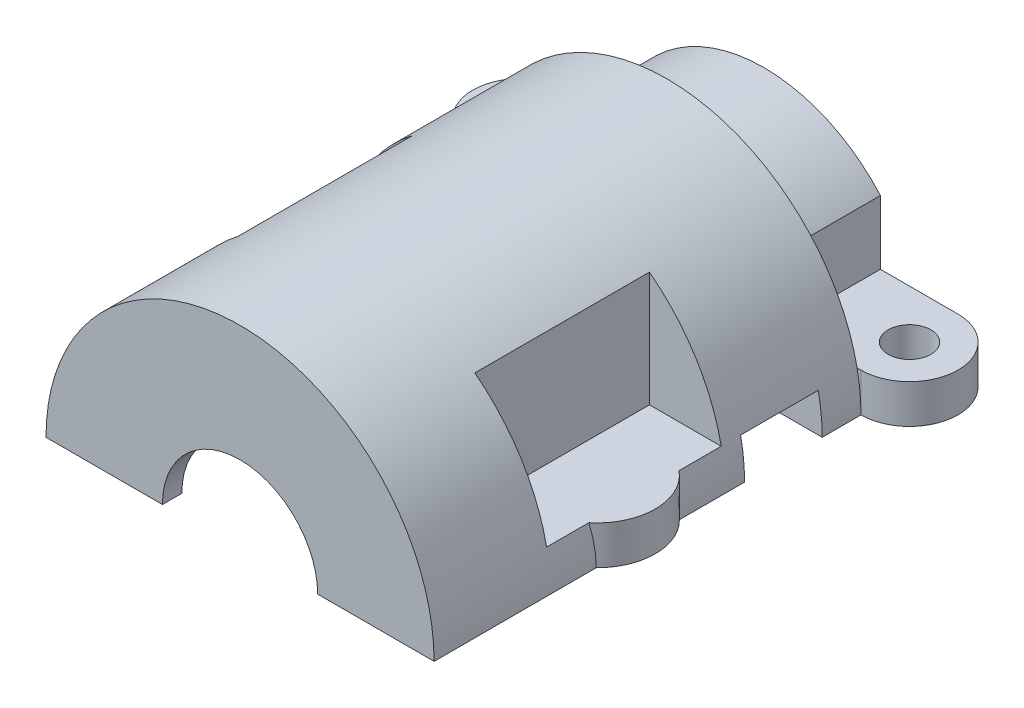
ISO-10303-21;
HEADER;
FILE_DESCRIPTION(('STEP AP214'),'2;1');
FILE_NAME('part.step','',(''),(''),'','','');
FILE_SCHEMA(('AUTOMOTIVE_DESIGN { 1 0 10303 214 1 1 1 1 }'));
ENDSEC;
DATA;
#1=APPLICATION_CONTEXT('core data for automotive mechanical design processes');
#2=APPLICATION_PROTOCOL_DEFINITION('international standard','automotive_design',2000,#1);
#3=PRODUCT_CONTEXT('',#1,'mechanical');
#4=PRODUCT('Part','Part','',(#3));
#5=PRODUCT_RELATED_PRODUCT_CATEGORY('part','',(#4));
#6=PRODUCT_DEFINITION_FORMATION('','',#4);
#7=PRODUCT_DEFINITION_CONTEXT('part definition',#1,'design');
#8=PRODUCT_DEFINITION('design','',#6,#7);
#9=PRODUCT_DEFINITION_SHAPE('','',#8);
#10=(LENGTH_UNIT() NAMED_UNIT(*) SI_UNIT(.MILLI.,.METRE.));
#11=(NAMED_UNIT(*) PLANE_ANGLE_UNIT() SI_UNIT($,.RADIAN.));
#12=(NAMED_UNIT(*) SI_UNIT($,.STERADIAN.) SOLID_ANGLE_UNIT());
#13=UNCERTAINTY_MEASURE_WITH_UNIT(LENGTH_MEASURE(1.E-05),#10,'distance_accuracy_value','');
#14=(GEOMETRIC_REPRESENTATION_CONTEXT(3) GLOBAL_UNCERTAINTY_ASSIGNED_CONTEXT((#13)) GLOBAL_UNIT_ASSIGNED_CONTEXT((#10,
#11,#12)) REPRESENTATION_CONTEXT('',''));
#15=CARTESIAN_POINT('',(0.,0.,0.));
#16=DIRECTION('',(0.,0.,1.));
#17=DIRECTION('',(1.,0.,0.));
#18=AXIS2_PLACEMENT_3D('',#15,#16,#17);
#19=CARTESIAN_POINT('',(-12.7,0.,0.));
#20=DIRECTION('',(0.,1.,0.));
#21=DIRECTION('',(0.,0.,1.));
#22=AXIS2_PLACEMENT_3D('',#19,#20,#21);
#23=PLANE('',#22);
#24=DIRECTION('',(0.,0.,1.));
#25=VECTOR('',#24,1.);
#26=CARTESIAN_POINT('',(12.7,0.,0.));
#27=LINE('',#26,#25);
#28=CARTESIAN_POINT('',(12.7,0.,13.97));
#29=VERTEX_POINT('',#28);
#30=CARTESIAN_POINT('',(12.7,0.,18.2341157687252));
#31=VERTEX_POINT('',#30);
#32=EDGE_CURVE('E278',#29,#31,#27,.T.);
#33=ORIENTED_EDGE('',*,*,#32,.T.);
#34=CARTESIAN_POINT('',(10.033,0.,20.955));
#35=DIRECTION('',(0.,1.,0.));
#36=DIRECTION('',(0.,0.,1.));
#37=AXIS2_PLACEMENT_3D('',#34,#35,#36);
#38=CIRCLE('',#37,3.81);
#39=CARTESIAN_POINT('',(12.7,0.,23.6758842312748));
#40=VERTEX_POINT('',#39);
#41=EDGE_CURVE('E49',#31,#40,#38,.F.);
#42=ORIENTED_EDGE('',*,*,#41,.T.);
#43=CARTESIAN_POINT('',(12.7,0.,34.29));
#44=VERTEX_POINT('',#43);
#45=EDGE_CURVE('E287',#40,#44,#27,.T.);
#46=ORIENTED_EDGE('',*,*,#45,.T.);
#47=DIRECTION('',(-1.,0.,0.));
#48=VECTOR('',#47,1.);
#49=CARTESIAN_POINT('',(-12.7,0.,34.29));
#50=LINE('',#49,#48);
#51=CARTESIAN_POINT('',(5.08,0.,34.29));
#52=VERTEX_POINT('',#51);
#53=EDGE_CURVE('E411',#44,#52,#50,.T.);
#54=ORIENTED_EDGE('',*,*,#53,.T.);
#55=DIRECTION('',(0.,0.,-1.));
#56=VECTOR('',#55,1.);
#57=CARTESIAN_POINT('',(5.08,0.,-2.01673929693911));
#58=LINE('',#57,#56);
#59=CARTESIAN_POINT('',(5.08,0.,33.02));
#60=VERTEX_POINT('',#59);
#61=EDGE_CURVE('E327',#52,#60,#58,.T.);
#62=ORIENTED_EDGE('',*,*,#61,.T.);
#63=DIRECTION('',(1.,0.,0.));
#64=VECTOR('',#63,1.);
#65=CARTESIAN_POINT('',(-12.7,0.,33.02));
#66=LINE('',#65,#64);
#67=CARTESIAN_POINT('',(7.9375,0.,33.02));
#68=VERTEX_POINT('',#67);
#69=EDGE_CURVE('E319',#60,#68,#66,.T.);
#70=ORIENTED_EDGE('',*,*,#69,.T.);
#71=DIRECTION('',(0.,0.,-1.));
#72=VECTOR('',#71,1.);
#73=CARTESIAN_POINT('',(7.9375,0.,-2.01673929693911));
#74=LINE('',#73,#72);
#75=CARTESIAN_POINT('',(7.9375,0.,27.94));
#76=VERTEX_POINT('',#75);
#77=EDGE_CURVE('E324',#68,#76,#74,.T.);
#78=ORIENTED_EDGE('',*,*,#77,.T.);
#79=DIRECTION('',(-1.,0.,0.));
#80=VECTOR('',#79,1.);
#81=CARTESIAN_POINT('',(-12.7,0.,27.94));
#82=LINE('',#81,#80);
#83=CARTESIAN_POINT('',(5.207,0.,27.94));
#84=VERTEX_POINT('',#83);
#85=EDGE_CURVE('E312',#76,#84,#82,.T.);
#86=ORIENTED_EDGE('',*,*,#85,.T.);
#87=DIRECTION('',(0.,0.,-1.));
#88=VECTOR('',#87,1.);
#89=CARTESIAN_POINT('',(5.207,0.,-2.01673929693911));
#90=LINE('',#89,#88);
#91=CARTESIAN_POINT('',(5.207,0.,13.97));
#92=VERTEX_POINT('',#91);
#93=EDGE_CURVE('E322',#84,#92,#90,.T.);
#94=ORIENTED_EDGE('',*,*,#93,.T.);
#95=DIRECTION('',(1.,0.,0.));
#96=VECTOR('',#95,1.);
#97=CARTESIAN_POINT('',(-12.7,0.,13.97));
#98=LINE('',#97,#96);
#99=EDGE_CURVE('E284',#92,#29,#98,.T.);
#100=ORIENTED_EDGE('',*,*,#99,.T.);
#101=EDGE_LOOP('',(#33,#42,#46,#54,#62,#70,#78,#86,#94,#100));
#102=FACE_BOUND('',#101,.T.);
#103=ADVANCED_FACE('F33',(#102),#23,.F.);
#104=DIRECTION('',(0.,0.,1.));
#105=VECTOR('',#104,1.);
#106=CARTESIAN_POINT('',(-12.7,0.,0.));
#107=LINE('',#106,#105);
#108=CARTESIAN_POINT('',(-12.7,0.,23.6758842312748));
#109=VERTEX_POINT('',#108);
#110=CARTESIAN_POINT('',(-12.7,0.,34.29));
#111=VERTEX_POINT('',#110);
#112=EDGE_CURVE('E289',#109,#111,#107,.T.);
#113=ORIENTED_EDGE('',*,*,#112,.F.);
#114=CARTESIAN_POINT('',(-10.033,0.,20.955));
#115=DIRECTION('',(0.,1.,0.));
#116=DIRECTION('',(0.,0.,1.));
#117=AXIS2_PLACEMENT_3D('',#114,#115,#116);
#118=CIRCLE('',#117,3.81);
#119=CARTESIAN_POINT('',(-12.7,0.,18.2341157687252));
#120=VERTEX_POINT('',#119);
#121=EDGE_CURVE('E480',#109,#120,#118,.F.);
#122=ORIENTED_EDGE('',*,*,#121,.T.);
#123=CARTESIAN_POINT('',(-12.7,0.,13.97));
#124=VERTEX_POINT('',#123);
#125=EDGE_CURVE('E57',#124,#120,#107,.T.);
#126=ORIENTED_EDGE('',*,*,#125,.F.);
#127=CARTESIAN_POINT('',(-5.207,0.,13.97));
#128=VERTEX_POINT('',#127);
#129=EDGE_CURVE('E301',#124,#128,#98,.T.);
#130=ORIENTED_EDGE('',*,*,#129,.T.);
#131=DIRECTION('',(0.,0.,-1.));
#132=VECTOR('',#131,1.);
#133=CARTESIAN_POINT('',(-5.207,0.,-2.01673929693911));
#134=LINE('',#133,#132);
#135=CARTESIAN_POINT('',(-5.207,0.,27.94));
#136=VERTEX_POINT('',#135);
#137=EDGE_CURVE('E305',#128,#136,#134,.F.);
#138=ORIENTED_EDGE('',*,*,#137,.T.);
#139=CARTESIAN_POINT('',(-7.9375,0.,27.94));
#140=VERTEX_POINT('',#139);
#141=EDGE_CURVE('E308',#136,#140,#82,.T.);
#142=ORIENTED_EDGE('',*,*,#141,.T.);
#143=DIRECTION('',(0.,0.,-1.));
#144=VECTOR('',#143,1.);
#145=CARTESIAN_POINT('',(-7.9375,0.,-2.01673929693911));
#146=LINE('',#145,#144);
#147=CARTESIAN_POINT('',(-7.9375,0.,33.02));
#148=VERTEX_POINT('',#147);
#149=EDGE_CURVE('E311',#140,#148,#146,.F.);
#150=ORIENTED_EDGE('',*,*,#149,.T.);
#151=CARTESIAN_POINT('',(-5.08,0.,33.02));
#152=VERTEX_POINT('',#151);
#153=EDGE_CURVE('E315',#148,#152,#66,.T.);
#154=ORIENTED_EDGE('',*,*,#153,.T.);
#155=DIRECTION('',(0.,0.,-1.));
#156=VECTOR('',#155,1.);
#157=CARTESIAN_POINT('',(-5.08,0.,-2.01673929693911));
#158=LINE('',#157,#156);
#159=CARTESIAN_POINT('',(-5.08,0.,34.29));
#160=VERTEX_POINT('',#159);
#161=EDGE_CURVE('E318',#152,#160,#158,.F.);
#162=ORIENTED_EDGE('',*,*,#161,.T.);
#163=EDGE_CURVE('E409',#160,#111,#50,.T.);
#164=ORIENTED_EDGE('',*,*,#163,.T.);
#165=EDGE_LOOP('',(#113,#122,#126,#130,#138,#142,#150,#154,#162,#164));
#166=FACE_BOUND('',#165,.T.);
#167=ADVANCED_FACE('F417',(#166),#23,.F.);
#168=CARTESIAN_POINT('',(12.7,0.,3.175));
#169=DIRECTION('',(0.,1.,0.));
#170=DIRECTION('',(-1.,0.,0.));
#171=AXIS2_PLACEMENT_3D('',#168,#169,#170);
#172=CIRCLE('',#171,1.397);
#173=CARTESIAN_POINT('',(11.303,0.,3.175));
#174=VERTEX_POINT('',#173);
#175=EDGE_CURVE('E645',#174,#174,#172,.T.);
#176=ORIENTED_EDGE('',*,*,#175,.T.);
#177=EDGE_LOOP('',(#176));
#178=FACE_BOUND('',#177,.T.);
#179=CARTESIAN_POINT('',(12.7,0.,3.175));
#180=DIRECTION('',(0.,1.,0.));
#181=DIRECTION('',(0.,0.,1.));
#182=AXIS2_PLACEMENT_3D('',#179,#180,#181);
#183=CIRCLE('',#182,3.175);
#184=CARTESIAN_POINT('',(12.7,0.,0.));
#185=VERTEX_POINT('',#184);
#186=CARTESIAN_POINT('',(12.7,0.,6.35));
#187=VERTEX_POINT('',#186);
#188=EDGE_CURVE('E648',#185,#187,#183,.F.);
#189=ORIENTED_EDGE('',*,*,#188,.T.);
#190=CARTESIAN_POINT('',(12.7,0.,8.89));
#191=VERTEX_POINT('',#190);
#192=EDGE_CURVE('E286',#187,#191,#27,.T.);
#193=ORIENTED_EDGE('',*,*,#192,.T.);
#194=DIRECTION('',(-1.,0.,0.));
#195=VECTOR('',#194,1.);
#196=CARTESIAN_POINT('',(-12.7,0.,8.89));
#197=LINE('',#196,#195);
#198=CARTESIAN_POINT('',(6.35,0.,8.89));
#199=VERTEX_POINT('',#198);
#200=EDGE_CURVE('E302',#191,#199,#197,.T.);
#201=ORIENTED_EDGE('',*,*,#200,.T.);
#202=DIRECTION('',(0.,0.,-1.));
#203=VECTOR('',#202,1.);
#204=CARTESIAN_POINT('',(6.35,0.,0.));
#205=LINE('',#204,#203);
#206=CARTESIAN_POINT('',(6.35,0.,0.));
#207=VERTEX_POINT('',#206);
#208=EDGE_CURVE('E683',#199,#207,#205,.T.);
#209=ORIENTED_EDGE('',*,*,#208,.T.);
#210=DIRECTION('',(-1.,0.,0.));
#211=VECTOR('',#210,1.);
#212=CARTESIAN_POINT('',(-12.7,0.,0.));
#213=LINE('',#212,#211);
#214=EDGE_CURVE('E290',#185,#207,#213,.T.);
#215=ORIENTED_EDGE('',*,*,#214,.F.);
#216=EDGE_LOOP('',(#189,#193,#201,#209,#215));
#217=FACE_BOUND('',#216,.T.);
#218=ADVANCED_FACE('F624',(#178,#217),#23,.F.);
#219=CARTESIAN_POINT('',(0.,0.,34.29));
#220=DIRECTION('',(0.,0.,-1.));
#221=DIRECTION('',(-1.,0.,0.));
#222=AXIS2_PLACEMENT_3D('',#219,#220,#221);
#223=CYLINDRICAL_SURFACE('',#222,12.7);
#224=ORIENTED_EDGE('',*,*,#45,.F.);
#225=CARTESIAN_POINT('',(10.16,-7.62,24.7628827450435));
#226=CARTESIAN_POINT('',(10.2416211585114,-7.51117495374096,24.7601541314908));
#227=CARTESIAN_POINT('',(10.3214384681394,-7.40110568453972,24.7548721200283));
#228=CARTESIAN_POINT('',(10.4773376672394,-7.17870608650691,24.7398123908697));
#229=CARTESIAN_POINT('',(10.5534208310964,-7.06637654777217,24.7300362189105));
#230=CARTESIAN_POINT('',(10.7756719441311,-6.72666507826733,24.6949222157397));
#231=CARTESIAN_POINT('',(10.9161590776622,-6.49613640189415,24.6637835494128));
#232=CARTESIAN_POINT('',(11.181571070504,-6.02785347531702,24.590361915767));
#233=CARTESIAN_POINT('',(11.3064824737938,-5.79009319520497,24.548069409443));
#234=CARTESIAN_POINT('',(11.5405835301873,-5.30817581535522,24.4562996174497));
#235=CARTESIAN_POINT('',(11.6497648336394,-5.06401539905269,24.4068185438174));
#236=CARTESIAN_POINT('',(11.8619308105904,-4.54643802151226,24.2996288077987));
#237=CARTESIAN_POINT('',(11.9633407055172,-4.27244570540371,24.2415851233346));
#238=CARTESIAN_POINT('',(12.1471070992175,-3.71794268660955,24.1264983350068));
#239=CARTESIAN_POINT('',(12.2294639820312,-3.437432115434,24.0694552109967));
#240=CARTESIAN_POINT('',(12.374698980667,-2.87090882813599,23.9617764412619));
#241=CARTESIAN_POINT('',(12.4376235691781,-2.58491100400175,23.9111256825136));
#242=CARTESIAN_POINT('',(12.5437655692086,-2.00749541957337,23.8215326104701));
#243=CARTESIAN_POINT('',(12.5869898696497,-1.71607959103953,23.7825862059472));
#244=CARTESIAN_POINT('',(12.6508875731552,-1.149222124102,23.7234919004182));
#245=CARTESIAN_POINT('',(12.6729007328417,-0.874050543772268,23.7022407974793));
#246=CARTESIAN_POINT('',(12.6989196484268,-0.322080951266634,23.6770068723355));
#247=CARTESIAN_POINT('',(12.7029288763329,-0.045283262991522,23.6730207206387));
#248=CARTESIAN_POINT('',(12.6928562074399,0.507992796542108,23.6828759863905));
#249=CARTESIAN_POINT('',(12.6787520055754,0.784470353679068,23.6967393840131));
#250=CARTESIAN_POINT('',(12.6326932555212,1.33466598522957,23.7404392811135));
#251=CARTESIAN_POINT('',(12.600733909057,1.60838329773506,23.7702800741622));
#252=CARTESIAN_POINT('',(12.5080433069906,2.22766148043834,23.8524272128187));
#253=CARTESIAN_POINT('',(12.4417589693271,2.57185990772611,23.9086857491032));
#254=CARTESIAN_POINT('',(12.2816115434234,3.25179449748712,24.0323423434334));
#255=CARTESIAN_POINT('',(12.1877328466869,3.58752575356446,24.0997466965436));
#256=CARTESIAN_POINT('',(11.9727797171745,4.2501800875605,24.2367116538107));
#257=CARTESIAN_POINT('',(11.8516708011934,4.57709140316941,24.3062748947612));
#258=CARTESIAN_POINT('',(11.5825022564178,5.2208437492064,24.4389142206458));
#259=CARTESIAN_POINT('',(11.4344605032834,5.53769129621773,24.5019945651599));
#260=CARTESIAN_POINT('',(11.1716763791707,6.04417496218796,24.5924436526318));
#261=CARTESIAN_POINT('',(11.0650663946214,6.23724026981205,24.6243629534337));
#262=CARTESIAN_POINT('',(10.8413477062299,6.61845968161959,24.6800454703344));
#263=CARTESIAN_POINT('',(10.7242387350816,6.80661366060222,24.7038084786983));
#264=CARTESIAN_POINT('',(10.4799567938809,7.17702292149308,24.7407061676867));
#265=CARTESIAN_POINT('',(10.3527975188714,7.35928576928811,24.7538550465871));
#266=CARTESIAN_POINT('',(10.0888292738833,7.71718245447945,24.766881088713));
#267=CARTESIAN_POINT('',(9.9520236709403,7.89281857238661,24.766762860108));
#268=CARTESIAN_POINT('',(9.70951930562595,8.18784145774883,24.752600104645));
#269=CARTESIAN_POINT('',(9.60591062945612,8.30913915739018,24.7424869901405));
#270=CARTESIAN_POINT('',(9.39482136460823,8.54708176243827,24.7126839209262));
#271=CARTESIAN_POINT('',(9.28734183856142,8.66372792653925,24.6929965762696));
#272=CARTESIAN_POINT('',(9.06965951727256,8.89134261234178,24.6428854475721));
#273=CARTESIAN_POINT('',(8.95946723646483,9.00232910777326,24.612498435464));
#274=CARTESIAN_POINT('',(8.73717178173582,9.21823530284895,24.5397752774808));
#275=CARTESIAN_POINT('',(8.62506920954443,9.32315686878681,24.4974428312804));
#276=CARTESIAN_POINT('',(8.36221388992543,9.56055971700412,24.3830374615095));
#277=CARTESIAN_POINT('',(8.21121056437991,9.69036235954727,24.3057483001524));
#278=CARTESIAN_POINT('',(7.98704348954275,9.87454527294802,24.1702552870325));
#279=CARTESIAN_POINT('',(7.91245886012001,9.93437310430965,24.1216301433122));
#280=CARTESIAN_POINT('',(7.76486161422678,10.0501614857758,24.0176468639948));
#281=CARTESIAN_POINT('',(7.69185052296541,10.1061183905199,23.9622825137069));
#282=CARTESIAN_POINT('',(7.62,10.16,23.903479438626));
#283=B_SPLINE_CURVE_WITH_KNOTS('',3,(#225,#226,#227,#228,#229,#230,#231,#232,#233,#234,#235,
#236,#237,#238,#239,#240,#241,#242,#243,#244,#245,#246,#247,#248,#249,#250,#251,#252,#253,#254,
#255,#256,#257,#258,#259,#260,#261,#262,#263,#264,#265,#266,#267,#268,#269,#270,#271,#272,#273,
#274,#275,#276,#277,#278,#279,#280,#281,#282),.UNSPECIFIED.,.F.,.F.,(4,2,2,2,2,2,2,2,2,2,2,2,2,
2,2,2,2,2,2,2,2,2,2,2,2,2,2,2,4),(0.,0.408080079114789,0.816019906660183,1.63031559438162,
2.4453099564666,3.26073534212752,4.15364845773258,5.04654357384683,5.93728647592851,
6.82771765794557,7.65726995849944,8.48666227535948,9.31707689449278,10.1477147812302,
11.211126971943,12.2751418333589,13.3405117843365,14.4051771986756,15.0733282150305,
15.7414962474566,16.4087689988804,17.075809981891,17.5549935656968,18.034046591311,
18.511469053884,18.9887438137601,19.6274162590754,19.9489674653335,20.2708174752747),.UNSPECIFIED.);
#284=CARTESIAN_POINT('',(12.4434078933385,2.54,23.9055988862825));
#285=VERTEX_POINT('',#284);
#286=EDGE_CURVE('E271',#40,#285,#283,.T.);
#287=ORIENTED_EDGE('',*,*,#286,.T.);
#288=DIRECTION('',(0.,0.,-1.));
#289=VECTOR('',#288,1.);
#290=CARTESIAN_POINT('',(12.4434078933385,2.54,34.29));
#291=LINE('',#290,#289);
#292=CARTESIAN_POINT('',(12.4434078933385,2.54,26.67));
#293=VERTEX_POINT('',#292);
#294=EDGE_CURVE('E330',#293,#285,#291,.T.);
#295=ORIENTED_EDGE('',*,*,#294,.F.);
#296=CARTESIAN_POINT('',(0.,0.,26.67));
#297=DIRECTION('',(0.,0.,1.));
#298=DIRECTION('',(1.,0.,0.));
#299=AXIS2_PLACEMENT_3D('',#296,#297,#298);
#300=CIRCLE('',#299,12.7);
#301=CARTESIAN_POINT('',(7.747,10.063497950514,26.67));
#302=VERTEX_POINT('',#301);
#303=EDGE_CURVE('E333',#293,#302,#300,.T.);
#304=ORIENTED_EDGE('',*,*,#303,.T.);
#305=DIRECTION('',(0.,0.,-1.));
#306=VECTOR('',#305,1.);
#307=CARTESIAN_POINT('',(7.747,10.063497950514,34.29));
#308=LINE('',#307,#306);
#309=CARTESIAN_POINT('',(7.747,10.063497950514,15.24));
#310=VERTEX_POINT('',#309);
#311=EDGE_CURVE('E336',#302,#310,#308,.T.);
#312=ORIENTED_EDGE('',*,*,#311,.T.);
#313=CARTESIAN_POINT('',(0.,0.,15.24));
#314=DIRECTION('',(0.,0.,-1.));
#315=DIRECTION('',(-1.,0.,0.));
#316=AXIS2_PLACEMENT_3D('',#313,#314,#315);
#317=CIRCLE('',#316,12.7);
#318=CARTESIAN_POINT('',(12.4434078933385,2.54,15.24));
#319=VERTEX_POINT('',#318);
#320=EDGE_CURVE('E339',#310,#319,#317,.T.);
#321=ORIENTED_EDGE('',*,*,#320,.T.);
#322=CARTESIAN_POINT('',(12.4434078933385,2.54,18.0044011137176));
#323=VERTEX_POINT('',#322);
#324=EDGE_CURVE('E280',#323,#319,#291,.T.);
#325=ORIENTED_EDGE('',*,*,#324,.F.);
#326=CARTESIAN_POINT('',(7.62,10.16,18.0065205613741));
#327=CARTESIAN_POINT('',(7.71221842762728,10.0908676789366,17.9310353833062));
#328=CARTESIAN_POINT('',(7.80635309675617,10.0182759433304,17.8612326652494));
#329=CARTESIAN_POINT('',(7.99683088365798,9.86687873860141,17.7326926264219));
#330=CARTESIAN_POINT('',(8.09316995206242,9.7880841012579,17.6739365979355));
#331=CARTESIAN_POINT('',(8.28568045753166,9.62565485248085,17.567530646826));
#332=CARTESIAN_POINT('',(8.38184182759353,9.54208386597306,17.5197643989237));
#333=CARTESIAN_POINT('',(8.57396094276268,9.36983704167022,17.4338663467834));
#334=CARTESIAN_POINT('',(8.6699185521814,9.28115850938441,17.3957396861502));
#335=CARTESIAN_POINT('',(8.89110231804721,9.07019844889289,17.3176969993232));
#336=CARTESIAN_POINT('',(9.01589121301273,8.9462281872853,17.2810964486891));
#337=CARTESIAN_POINT('',(9.26171897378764,8.69148611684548,17.2217406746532));
#338=CARTESIAN_POINT('',(9.3827570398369,8.56071287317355,17.198988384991));
#339=CARTESIAN_POINT('',(9.62044322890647,8.29272535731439,17.1654926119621));
#340=CARTESIAN_POINT('',(9.73706905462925,8.15548466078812,17.15480383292));
#341=CARTESIAN_POINT('',(9.96457679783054,7.8758955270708,17.1439120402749));
#342=CARTESIAN_POINT('',(10.0754566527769,7.7335452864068,17.1437127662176));
#343=CARTESIAN_POINT('',(10.3504744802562,7.36450823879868,17.1545585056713));
#344=CARTESIAN_POINT('',(10.510181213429,7.13468887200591,17.1718784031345));
#345=CARTESIAN_POINT('',(10.8133619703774,6.66627146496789,17.2226053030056));
#346=CARTESIAN_POINT('',(10.9568266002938,6.42766844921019,17.2560215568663));
#347=CARTESIAN_POINT('',(11.2273525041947,5.942545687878,17.3342983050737));
#348=CARTESIAN_POINT('',(11.3543789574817,5.69601047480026,17.379182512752));
#349=CARTESIAN_POINT('',(11.5915486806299,5.19639076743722,17.4760023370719));
#350=CARTESIAN_POINT('',(11.7016944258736,4.94330723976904,17.5279369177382));
#351=CARTESIAN_POINT('',(11.9127260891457,4.41188224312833,17.6386822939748));
#352=CARTESIAN_POINT('',(12.0123025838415,4.133067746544,17.6977168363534));
#353=CARTESIAN_POINT('',(12.1918711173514,3.5687486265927,17.813852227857));
#354=CARTESIAN_POINT('',(12.2718600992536,3.28324296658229,17.8709527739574));
#355=CARTESIAN_POINT('',(12.411643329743,2.70713766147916,17.9774416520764));
#356=CARTESIAN_POINT('',(12.4715184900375,2.41656349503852,18.0268604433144));
#357=CARTESIAN_POINT('',(12.5709712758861,1.83004766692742,18.1126153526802));
#358=CARTESIAN_POINT('',(12.6105545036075,1.53410751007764,18.1489550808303));
#359=CARTESIAN_POINT('',(12.6666335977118,0.960740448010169,18.2015553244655));
#360=CARTESIAN_POINT('',(12.6846345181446,0.683583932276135,18.2191140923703));
#361=CARTESIAN_POINT('',(12.7023917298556,0.128141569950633,18.2364308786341));
#362=CARTESIAN_POINT('',(12.702150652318,-0.150144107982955,18.2361914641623));
#363=CARTESIAN_POINT('',(12.6834070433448,-0.706279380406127,18.2179212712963));
#364=CARTESIAN_POINT('',(12.6648526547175,-0.984125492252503,18.1998399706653));
#365=CARTESIAN_POINT('',(12.6097596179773,-1.53658363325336,18.1482576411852));
#366=CARTESIAN_POINT('',(12.5732159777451,-1.81119474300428,18.114752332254));
#367=CARTESIAN_POINT('',(12.4695550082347,-2.43450840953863,18.0249406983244));
#368=CARTESIAN_POINT('',(12.3966550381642,-2.78169649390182,17.9648436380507));
#369=CARTESIAN_POINT('',(12.2226707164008,-3.46720737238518,17.8351952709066));
#370=CARTESIAN_POINT('',(12.1215702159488,-3.80552496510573,17.7656385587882));
#371=CARTESIAN_POINT('',(11.8918174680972,-4.47198748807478,17.6264990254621));
#372=CARTESIAN_POINT('',(11.7632136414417,-4.80014915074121,17.5569164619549));
#373=CARTESIAN_POINT('',(11.4785396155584,-5.44586986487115,17.426396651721));
#374=CARTESIAN_POINT('',(11.3224923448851,-5.76343750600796,17.3654522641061));
#375=CARTESIAN_POINT('',(11.0071660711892,-6.34230259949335,17.2684985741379));
#376=CARTESIAN_POINT('',(10.8515188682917,-6.60516811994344,17.2301731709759));
#377=CARTESIAN_POINT('',(10.6032465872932,-6.99175739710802,17.1869788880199));
#378=CARTESIAN_POINT('',(10.5179563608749,-7.11942363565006,17.1749596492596));
#379=CARTESIAN_POINT('',(10.3425522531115,-7.37192483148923,17.1565737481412));
#380=CARTESIAN_POINT('',(10.2524354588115,-7.49675801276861,17.1502105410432));
#381=CARTESIAN_POINT('',(10.16,-7.62,17.1471172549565));
#382=B_SPLINE_CURVE_WITH_KNOTS('',3,(#326,#327,#328,#329,#330,#331,#332,#333,#334,#335,#336,
#337,#338,#339,#340,#341,#342,#343,#344,#345,#346,#347,#348,#349,#350,#351,#352,#353,#354,#355,
#356,#357,#358,#359,#360,#361,#362,#363,#364,#365,#366,#367,#368,#369,#370,#371,#372,#373,#374,
#375,#376,#377,#378,#379,#380,#381),.UNSPECIFIED.,.F.,.F.,(4,2,2,2,2,2,2,2,2,2,2,2,2,2,2,2,2,2,
2,2,2,2,2,2,2,2,2,4),(0.,0.413011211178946,0.825316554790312,1.23303324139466,1.64096702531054,
2.17914885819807,2.71744466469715,3.25817179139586,3.79909168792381,4.63894463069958,
5.47928085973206,6.32136899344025,7.16333352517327,8.06829396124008,8.973395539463,
9.87481130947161,10.7759780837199,11.6097591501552,12.4434199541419,13.2794481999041,
14.1157085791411,15.1935602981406,16.272030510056,17.3486174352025,18.424309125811,
19.3466574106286,19.8084884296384,20.270601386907),.UNSPECIFIED.);
#383=EDGE_CURVE('E268',#323,#31,#382,.T.);
#384=ORIENTED_EDGE('',*,*,#383,.T.);
#385=ORIENTED_EDGE('',*,*,#32,.F.);
#386=CARTESIAN_POINT('',(0.,0.,13.97));
#387=DIRECTION('',(0.,0.,1.));
#388=DIRECTION('',(1.,0.,0.));
#389=AXIS2_PLACEMENT_3D('',#386,#387,#388);
#390=CIRCLE('',#389,12.7);
#391=CARTESIAN_POINT('',(12.4434078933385,2.54,13.97));
#392=VERTEX_POINT('',#391);
#393=EDGE_CURVE('E373',#29,#392,#390,.T.);
#394=ORIENTED_EDGE('',*,*,#393,.T.);
#395=DIRECTION('',(0.,0.,-1.));
#396=VECTOR('',#395,1.);
#397=CARTESIAN_POINT('',(12.4434078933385,2.54,34.29));
#398=LINE('',#397,#396);
#399=CARTESIAN_POINT('',(12.4434078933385,2.54,8.89));
#400=VERTEX_POINT('',#399);
#401=EDGE_CURVE('E463',#392,#400,#398,.T.);
#402=ORIENTED_EDGE('',*,*,#401,.T.);
#403=CARTESIAN_POINT('',(0.,0.,8.89));
#404=DIRECTION('',(0.,0.,-1.));
#405=DIRECTION('',(-1.,0.,0.));
#406=AXIS2_PLACEMENT_3D('',#403,#404,#405);
#407=CIRCLE('',#406,12.7);
#408=EDGE_CURVE('E448',#400,#191,#407,.T.);
#409=ORIENTED_EDGE('',*,*,#408,.T.);
#410=ORIENTED_EDGE('',*,*,#192,.F.);
#411=CARTESIAN_POINT('',(0.,0.,6.35));
#412=DIRECTION('',(0.,0.,1.));
#413=DIRECTION('',(1.,0.,0.));
#414=AXIS2_PLACEMENT_3D('',#411,#412,#413);
#415=CIRCLE('',#414,12.7);
#416=CARTESIAN_POINT('',(12.4434078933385,2.54,6.35));
#417=VERTEX_POINT('',#416);
#418=EDGE_CURVE('E655',#187,#417,#415,.T.);
#419=ORIENTED_EDGE('',*,*,#418,.T.);
#420=CARTESIAN_POINT('',(0.,0.,6.35));
#421=DIRECTION('',(0.,0.,-1.));
#422=DIRECTION('',(-1.,0.,0.));
#423=AXIS2_PLACEMENT_3D('',#420,#421,#422);
#424=CIRCLE('',#423,12.7);
#425=CARTESIAN_POINT('',(-12.4434078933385,2.54,6.35));
#426=VERTEX_POINT('',#425);
#427=EDGE_CURVE('E745',#426,#417,#424,.T.);
#428=ORIENTED_EDGE('',*,*,#427,.F.);
#429=CARTESIAN_POINT('',(0.,0.,6.35));
#430=DIRECTION('',(0.,0.,1.));
#431=DIRECTION('',(1.,0.,0.));
#432=AXIS2_PLACEMENT_3D('',#429,#430,#431);
#433=CIRCLE('',#432,12.7);
#434=CARTESIAN_POINT('',(-12.7,0.,6.35));
#435=VERTEX_POINT('',#434);
#436=EDGE_CURVE('E433',#426,#435,#433,.T.);
#437=ORIENTED_EDGE('',*,*,#436,.T.);
#438=CARTESIAN_POINT('',(-12.7,0.,8.89));
#439=VERTEX_POINT('',#438);
#440=EDGE_CURVE('E293',#435,#439,#107,.T.);
#441=ORIENTED_EDGE('',*,*,#440,.T.);
#442=CARTESIAN_POINT('',(-12.4434078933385,2.54,8.89));
#443=VERTEX_POINT('',#442);
#444=EDGE_CURVE('E430',#439,#443,#407,.T.);
#445=ORIENTED_EDGE('',*,*,#444,.T.);
#446=DIRECTION('',(0.,0.,-1.));
#447=VECTOR('',#446,1.);
#448=CARTESIAN_POINT('',(-12.4434078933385,2.54,34.29));
#449=LINE('',#448,#447);
#450=CARTESIAN_POINT('',(-12.4434078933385,2.54,13.97));
#451=VERTEX_POINT('',#450);
#452=EDGE_CURVE('E461',#443,#451,#449,.F.);
#453=ORIENTED_EDGE('',*,*,#452,.T.);
#454=EDGE_CURVE('E466',#451,#124,#390,.T.);
#455=ORIENTED_EDGE('',*,*,#454,.T.);
#456=ORIENTED_EDGE('',*,*,#125,.T.);
#457=CARTESIAN_POINT('',(-12.7,0.,18.2341157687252));
#458=CARTESIAN_POINT('',(-12.7000033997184,0.134876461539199,18.2341394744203));
#459=CARTESIAN_POINT('',(-12.6978514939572,0.269746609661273,18.2320102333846));
#460=CARTESIAN_POINT('',(-12.6892635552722,0.5391968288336,18.2236213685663));
#461=CARTESIAN_POINT('',(-12.6828283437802,0.673776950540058,18.2173625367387));
#462=CARTESIAN_POINT('',(-12.6657169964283,0.942159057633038,18.2009059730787));
#463=CARTESIAN_POINT('',(-12.6550491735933,1.0759620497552,18.1907159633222));
#464=CARTESIAN_POINT('',(-12.6295193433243,1.34283825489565,18.1667222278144));
#465=CARTESIAN_POINT('',(-12.6146571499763,1.47591143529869,18.1529183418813));
#466=CARTESIAN_POINT('',(-12.5638311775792,1.87395736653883,18.1066473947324));
#467=CARTESIAN_POINT('',(-12.5216379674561,2.13760155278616,18.0693313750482));
#468=CARTESIAN_POINT('',(-12.4210826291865,2.66038649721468,17.9855856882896));
#469=CARTESIAN_POINT('',(-12.3627107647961,2.91952444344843,17.9391505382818));
#470=CARTESIAN_POINT('',(-12.2085537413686,3.51634511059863,17.8253059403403));
#471=CARTESIAN_POINT('',(-12.1067751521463,3.85212575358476,17.7559904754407));
#472=CARTESIAN_POINT('',(-11.8757869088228,4.51427831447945,17.617577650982));
#473=CARTESIAN_POINT('',(-11.746566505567,4.8406464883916,17.5484803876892));
#474=CARTESIAN_POINT('',(-11.4611187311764,5.48230595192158,17.4193143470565));
#475=CARTESIAN_POINT('',(-11.3049593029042,5.7976227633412,17.3592235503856));
#476=CARTESIAN_POINT('',(-10.9657391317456,6.41613961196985,17.256689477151));
#477=CARTESIAN_POINT('',(-10.7827070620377,6.71935213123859,17.2142275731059));
#478=CARTESIAN_POINT('',(-10.3962227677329,7.30252597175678,17.1574819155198));
#479=CARTESIAN_POINT('',(-10.1935537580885,7.58291287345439,17.142386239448));
#480=CARTESIAN_POINT('',(-9.87305694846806,7.99016379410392,17.146862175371));
#481=CARTESIAN_POINT('',(-9.76344742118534,8.12372307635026,17.1528787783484));
#482=CARTESIAN_POINT('',(-9.53931485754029,8.38577020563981,17.1754414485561));
#483=CARTESIAN_POINT('',(-9.42479260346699,8.51425885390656,17.1919858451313));
#484=CARTESIAN_POINT('',(-9.20910977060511,8.74663128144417,17.2337766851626));
#485=CARTESIAN_POINT('',(-9.10850253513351,8.85132747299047,17.2573580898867));
#486=CARTESIAN_POINT('',(-8.90515253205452,9.05588423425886,17.3142306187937));
#487=CARTESIAN_POINT('',(-8.8024103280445,9.15574605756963,17.3475192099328));
#488=CARTESIAN_POINT('',(-8.59606125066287,9.34974466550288,17.4246455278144));
#489=CARTESIAN_POINT('',(-8.49245775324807,9.4438972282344,17.4684523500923));
#490=CARTESIAN_POINT('',(-8.28539734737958,9.62606811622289,17.5675020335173));
#491=CARTESIAN_POINT('',(-8.18194038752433,9.71409033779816,17.6227375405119));
#492=CARTESIAN_POINT('',(-8.00132849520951,9.86300933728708,17.730615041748));
#493=CARTESIAN_POINT('',(-7.92382441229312,9.92534341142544,17.780693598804));
#494=CARTESIAN_POINT('',(-7.77045735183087,10.0458738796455,17.8881142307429));
#495=CARTESIAN_POINT('',(-7.69459656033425,10.1040649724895,17.9454653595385));
#496=CARTESIAN_POINT('',(-7.62,10.16,18.0065205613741));
#497=B_SPLINE_CURVE_WITH_KNOTS('',3,(#457,#458,#459,#460,#461,#462,#463,#464,#465,#466,#467,
#468,#469,#470,#471,#472,#473,#474,#475,#476,#477,#478,#479,#480,#481,#482,#483,#484,#485,#486,
#487,#488,#489,#490,#491,#492,#493,#494,#495,#496),.UNSPECIFIED.,.F.,.F.,(4,2,2,2,2,2,2,2,2,2,2,
2,2,2,2,2,2,2,2,4),(0.,0.404585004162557,0.809092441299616,1.21280931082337,1.6165440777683,
2.42447909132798,3.23290137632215,4.30457869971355,5.37667658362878,6.44610904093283,
7.51440859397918,8.5504592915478,9.06873424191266,9.58692696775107,10.0278659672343,
10.4686900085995,10.9082343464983,11.347496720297,11.6812569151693,12.0154367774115),.UNSPECIFIED.);
#498=CARTESIAN_POINT('',(-12.4434078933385,2.54,18.0044011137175));
#499=VERTEX_POINT('',#498);
#500=EDGE_CURVE('E481',#120,#499,#497,.T.);
#501=ORIENTED_EDGE('',*,*,#500,.T.);
#502=DIRECTION('',(0.,0.,-1.));
#503=VECTOR('',#502,1.);
#504=CARTESIAN_POINT('',(-12.4434078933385,2.54,34.29));
#505=LINE('',#504,#503);
#506=CARTESIAN_POINT('',(-12.4434078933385,2.54,15.24));
#507=VERTEX_POINT('',#506);
#508=EDGE_CURVE('E341',#499,#507,#505,.T.);
#509=ORIENTED_EDGE('',*,*,#508,.T.);
#510=CARTESIAN_POINT('',(0.,0.,15.24));
#511=DIRECTION('',(0.,0.,-1.));
#512=DIRECTION('',(-1.,0.,0.));
#513=AXIS2_PLACEMENT_3D('',#510,#511,#512);
#514=CIRCLE('',#513,12.7);
#515=CARTESIAN_POINT('',(-7.747,10.063497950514,15.24));
#516=VERTEX_POINT('',#515);
#517=EDGE_CURVE('E344',#507,#516,#514,.T.);
#518=ORIENTED_EDGE('',*,*,#517,.T.);
#519=DIRECTION('',(0.,0.,-1.));
#520=VECTOR('',#519,1.);
#521=CARTESIAN_POINT('',(-7.747,10.063497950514,34.29));
#522=LINE('',#521,#520);
#523=CARTESIAN_POINT('',(-7.747,10.063497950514,26.67));
#524=VERTEX_POINT('',#523);
#525=EDGE_CURVE('E42',#516,#524,#522,.F.);
#526=ORIENTED_EDGE('',*,*,#525,.T.);
#527=CARTESIAN_POINT('',(0.,0.,26.67));
#528=DIRECTION('',(0.,0.,1.));
#529=DIRECTION('',(1.,0.,0.));
#530=AXIS2_PLACEMENT_3D('',#527,#528,#529);
#531=CIRCLE('',#530,12.7);
#532=CARTESIAN_POINT('',(-12.4434078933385,2.54,26.67));
#533=VERTEX_POINT('',#532);
#534=EDGE_CURVE('E11',#524,#533,#531,.T.);
#535=ORIENTED_EDGE('',*,*,#534,.T.);
#536=CARTESIAN_POINT('',(-12.4434078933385,2.54,23.9055988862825));
#537=VERTEX_POINT('',#536);
#538=EDGE_CURVE('E342',#533,#537,#505,.T.);
#539=ORIENTED_EDGE('',*,*,#538,.T.);
#540=CARTESIAN_POINT('',(-7.62,10.16,23.903479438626));
#541=CARTESIAN_POINT('',(-7.71221156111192,10.0908728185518,23.978958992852));
#542=CARTESIAN_POINT('',(-7.80633908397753,10.0182867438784,24.0487569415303));
#543=CARTESIAN_POINT('',(-7.99680239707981,9.86690171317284,24.1772890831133));
#544=CARTESIAN_POINT('',(-8.09313413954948,9.78811358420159,24.2360419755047));
#545=CARTESIAN_POINT('',(-8.28564439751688,9.62568600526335,24.3424510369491));
#546=CARTESIAN_POINT('',(-8.38181297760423,9.54210933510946,24.3902219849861));
#547=CARTESIAN_POINT('',(-8.5739465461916,9.36985034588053,24.4761279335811));
#548=CARTESIAN_POINT('',(-8.66991139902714,9.28116533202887,24.5142577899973));
#549=CARTESIAN_POINT('',(-8.8911075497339,9.07019345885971,24.5923048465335));
#550=CARTESIAN_POINT('',(-9.01590158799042,8.94621787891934,24.6289065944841));
#551=CARTESIAN_POINT('',(-9.2617393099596,8.69146459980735,24.6882636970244));
#552=CARTESIAN_POINT('',(-9.3827821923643,8.56068546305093,24.7110161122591));
#553=CARTESIAN_POINT('',(-9.62046759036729,8.29269693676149,24.7445098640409));
#554=CARTESIAN_POINT('',(-9.7370882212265,8.15546161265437,24.7551975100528));
#555=CARTESIAN_POINT('',(-9.96458602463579,7.8758836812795,24.7660879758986));
#556=CARTESIAN_POINT('',(-10.0754611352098,7.73353927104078,24.7662870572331));
#557=CARTESIAN_POINT('',(-10.350468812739,7.36451584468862,24.7554417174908));
#558=CARTESIAN_POINT('',(-10.5101703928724,7.13470444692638,24.7381227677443));
#559=CARTESIAN_POINT('',(-10.8133431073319,6.66630175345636,24.6873984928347));
#560=CARTESIAN_POINT('',(-10.9568047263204,6.42770541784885,24.6539837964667));
#561=CARTESIAN_POINT('',(-11.2273351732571,5.94257902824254,24.5757076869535));
#562=CARTESIAN_POINT('',(-11.3543679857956,5.69603297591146,24.5308217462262));
#563=CARTESIAN_POINT('',(-11.5915453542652,5.19639838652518,24.4339992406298));
#564=CARTESIAN_POINT('',(-11.7016928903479,4.94331101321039,24.382063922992));
#565=CARTESIAN_POINT('',(-11.9127405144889,4.41184601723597,24.2713100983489));
#566=CARTESIAN_POINT('',(-12.0123288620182,4.13299455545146,24.212267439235));
#567=CARTESIAN_POINT('',(-12.1919269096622,3.56856389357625,24.0961104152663));
#568=CARTESIAN_POINT('',(-12.2719311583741,3.28298284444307,24.0389965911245));
#569=CARTESIAN_POINT('',(-12.4117208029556,2.70678572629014,23.932495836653));
#570=CARTESIAN_POINT('',(-12.4715910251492,2.41619634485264,23.8830769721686));
#571=CARTESIAN_POINT('',(-12.5710067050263,1.82977811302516,23.797354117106));
#572=CARTESIAN_POINT('',(-12.6105679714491,1.53395352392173,23.761039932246));
#573=CARTESIAN_POINT('',(-12.659698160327,1.0316613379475,23.7149446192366));
#574=CARTESIAN_POINT('',(-12.6747765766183,0.826164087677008,23.7004180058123));
#575=CARTESIAN_POINT('',(-12.6898929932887,0.517007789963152,23.6857628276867));
#576=CARTESIAN_POINT('',(-12.6936816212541,0.413686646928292,23.6820667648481));
#577=CARTESIAN_POINT('',(-12.6987356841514,0.206912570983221,23.6771238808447));
#578=CARTESIAN_POINT('',(-12.7000008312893,0.103459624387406,23.6758773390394));
#579=CARTESIAN_POINT('',(-12.7,0.,23.6758842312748));
#580=B_SPLINE_CURVE_WITH_KNOTS('',3,(#540,#541,#542,#543,#544,#545,#546,#547,#548,#549,#550,
#551,#552,#553,#554,#555,#556,#557,#558,#559,#560,#561,#562,#563,#564,#565,#566,#567,#568,#569,
#570,#571,#572,#573,#574,#575,#576,#577,#578,#579),.UNSPECIFIED.,.F.,.F.,(4,2,2,2,2,2,2,2,2,2,2,
2,2,2,2,2,2,2,2,4),(0.,0.412980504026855,0.825255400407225,1.23300266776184,1.64096703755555,
2.17917123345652,2.71748961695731,3.25819429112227,3.79909169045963,4.63891619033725,
5.47923024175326,6.32135629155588,7.16333353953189,8.068413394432,8.97374490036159,
9.8752129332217,10.7759781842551,11.3952044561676,11.7055199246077,12.015870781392),.UNSPECIFIED.);
#581=EDGE_CURVE('E424',#537,#109,#580,.T.);
#582=ORIENTED_EDGE('',*,*,#581,.T.);
#583=ORIENTED_EDGE('',*,*,#112,.T.);
#584=CARTESIAN_POINT('',(0.,0.,34.29));
#585=DIRECTION('',(0.,0.,1.));
#586=DIRECTION('',(1.,0.,0.));
#587=AXIS2_PLACEMENT_3D('',#584,#585,#586);
#588=CIRCLE('',#587,12.7);
#589=EDGE_CURVE('E295',#44,#111,#588,.T.);
#590=ORIENTED_EDGE('',*,*,#589,.F.);
#591=EDGE_LOOP('',(#224,#287,#295,#304,#312,#321,#325,#384,#385,#394,#402,#409,#410,#419,#428,
#437,#441,#445,#453,#455,#456,#501,#509,#518,#526,#535,#539,#582,#583,#590));
#592=FACE_BOUND('',#591,.T.);
#593=ADVANCED_FACE('F35',(#592),#223,.T.);
#594=CARTESIAN_POINT('',(0.,0.,34.29));
#595=DIRECTION('',(0.,0.,1.));
#596=DIRECTION('',(1.,0.,0.));
#597=AXIS2_PLACEMENT_3D('',#594,#595,#596);
#598=PLANE('',#597);
#599=CARTESIAN_POINT('',(0.,0.,34.29));
#600=DIRECTION('',(0.,0.,-1.));
#601=DIRECTION('',(-1.,0.,0.));
#602=AXIS2_PLACEMENT_3D('',#599,#600,#601);
#603=CIRCLE('',#602,5.08);
#604=EDGE_CURVE('E406',#160,#52,#603,.T.);
#605=ORIENTED_EDGE('',*,*,#604,.T.);
#606=ORIENTED_EDGE('',*,*,#53,.F.);
#607=ORIENTED_EDGE('',*,*,#589,.T.);
#608=ORIENTED_EDGE('',*,*,#163,.F.);
#609=EDGE_LOOP('',(#605,#606,#607,#608));
#610=FACE_BOUND('',#609,.T.);
#611=ADVANCED_FACE('F422',(#610),#598,.T.);
#612=CARTESIAN_POINT('',(0.,0.,0.));
#613=DIRECTION('',(0.,0.,1.));
#614=DIRECTION('',(1.,0.,0.));
#615=AXIS2_PLACEMENT_3D('',#612,#613,#614);
#616=PLANE('',#615);
#617=DIRECTION('',(0.,1.,0.));
#618=VECTOR('',#617,1.);
#619=CARTESIAN_POINT('',(7.62,2.54,0.));
#620=LINE('',#619,#618);
#621=CARTESIAN_POINT('',(7.62,2.54,0.));
#622=VERTEX_POINT('',#621);
#623=CARTESIAN_POINT('',(7.62,6.72020833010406,0.));
#624=VERTEX_POINT('',#623);
#625=EDGE_CURVE('E729',#622,#624,#620,.T.);
#626=ORIENTED_EDGE('',*,*,#625,.F.);
#627=DIRECTION('',(-1.,0.,0.));
#628=VECTOR('',#627,1.);
#629=CARTESIAN_POINT('',(9.83737769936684,2.54,0.));
#630=LINE('',#629,#628);
#631=CARTESIAN_POINT('',(12.7,2.54,0.));
#632=VERTEX_POINT('',#631);
#633=EDGE_CURVE('E703',#632,#622,#630,.T.);
#634=ORIENTED_EDGE('',*,*,#633,.F.);
#635=DIRECTION('',(0.,1.,0.));
#636=VECTOR('',#635,1.);
#637=CARTESIAN_POINT('',(12.7,-9.20534940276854,0.));
#638=LINE('',#637,#636);
#639=EDGE_CURVE('E702',#185,#632,#638,.T.);
#640=ORIENTED_EDGE('',*,*,#639,.F.);
#641=ORIENTED_EDGE('',*,*,#214,.T.);
#642=DIRECTION('',(0.,-1.,0.));
#643=VECTOR('',#642,1.);
#644=CARTESIAN_POINT('',(6.35,12.701,0.));
#645=LINE('',#644,#643);
#646=CARTESIAN_POINT('',(6.35,5.0736460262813,0.));
#647=VERTEX_POINT('',#646);
#648=EDGE_CURVE('E672',#647,#207,#645,.T.);
#649=ORIENTED_EDGE('',*,*,#648,.F.);
#650=CARTESIAN_POINT('',(0.,0.,0.));
#651=DIRECTION('',(0.,0.,-1.));
#652=DIRECTION('',(-1.,0.,0.));
#653=AXIS2_PLACEMENT_3D('',#650,#651,#652);
#654=CIRCLE('',#653,8.128);
#655=CARTESIAN_POINT('',(-6.35,5.0736460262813,0.));
#656=VERTEX_POINT('',#655);
#657=EDGE_CURVE('E363',#656,#647,#654,.T.);
#658=ORIENTED_EDGE('',*,*,#657,.F.);
#659=DIRECTION('',(0.,-1.,0.));
#660=VECTOR('',#659,1.);
#661=CARTESIAN_POINT('',(-6.35,12.701,0.));
#662=LINE('',#661,#660);
#663=CARTESIAN_POINT('',(-6.35,0.,0.));
#664=VERTEX_POINT('',#663);
#665=EDGE_CURVE('E681',#656,#664,#662,.T.);
#666=ORIENTED_EDGE('',*,*,#665,.T.);
#667=CARTESIAN_POINT('',(-12.7,0.,0.));
#668=VERTEX_POINT('',#667);
#669=EDGE_CURVE('E410',#664,#668,#213,.T.);
#670=ORIENTED_EDGE('',*,*,#669,.T.);
#671=DIRECTION('',(0.,1.,0.));
#672=VECTOR('',#671,1.);
#673=CARTESIAN_POINT('',(-12.7,-9.20534940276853,0.));
#674=LINE('',#673,#672);
#675=CARTESIAN_POINT('',(-12.7,2.54,0.));
#676=VERTEX_POINT('',#675);
#677=EDGE_CURVE('E712',#668,#676,#674,.T.);
#678=ORIENTED_EDGE('',*,*,#677,.T.);
#679=DIRECTION('',(-1.,0.,0.));
#680=VECTOR('',#679,1.);
#681=CARTESIAN_POINT('',(-12.4434078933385,2.54,0.));
#682=LINE('',#681,#680);
#683=CARTESIAN_POINT('',(-7.62,2.54,0.));
#684=VERTEX_POINT('',#683);
#685=EDGE_CURVE('E749',#684,#676,#682,.T.);
#686=ORIENTED_EDGE('',*,*,#685,.F.);
#687=DIRECTION('',(0.,-1.,0.));
#688=VECTOR('',#687,1.);
#689=CARTESIAN_POINT('',(-7.62,2.54,0.));
#690=LINE('',#689,#688);
#691=CARTESIAN_POINT('',(-7.62,6.72020833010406,0.));
#692=VERTEX_POINT('',#691);
#693=EDGE_CURVE('E723',#692,#684,#690,.T.);
#694=ORIENTED_EDGE('',*,*,#693,.F.);
#695=CARTESIAN_POINT('',(0.,0.,0.));
#696=DIRECTION('',(0.,0.,1.));
#697=DIRECTION('',(-1.,0.,0.));
#698=AXIS2_PLACEMENT_3D('',#695,#696,#697);
#699=CIRCLE('',#698,10.16);
#700=EDGE_CURVE('E757',#624,#692,#699,.T.);
#701=ORIENTED_EDGE('',*,*,#700,.F.);
#702=EDGE_LOOP('',(#626,#634,#640,#641,#649,#658,#666,#670,#678,#686,#694,#701));
#703=FACE_BOUND('',#702,.T.);
#704=ADVANCED_FACE('F622',(#703),#616,.F.);
#705=CARTESIAN_POINT('',(-12.7,0.,3.175));
#706=DIRECTION('',(0.,1.,0.));
#707=DIRECTION('',(-1.,0.,0.));
#708=AXIS2_PLACEMENT_3D('',#705,#706,#707);
#709=CIRCLE('',#708,1.397);
#710=CARTESIAN_POINT('',(-14.097,0.,3.175));
#711=VERTEX_POINT('',#710);
#712=EDGE_CURVE('E778',#711,#711,#709,.T.);
#713=ORIENTED_EDGE('',*,*,#712,.T.);
#714=EDGE_LOOP('',(#713));
#715=FACE_BOUND('',#714,.T.);
#716=CARTESIAN_POINT('',(-12.7,0.,3.175));
#717=DIRECTION('',(0.,1.,0.));
#718=DIRECTION('',(0.,0.,1.));
#719=AXIS2_PLACEMENT_3D('',#716,#717,#718);
#720=CIRCLE('',#719,3.175);
#721=EDGE_CURVE('E710',#435,#668,#720,.F.);
#722=ORIENTED_EDGE('',*,*,#721,.T.);
#723=ORIENTED_EDGE('',*,*,#669,.F.);
#724=DIRECTION('',(0.,0.,1.));
#725=VECTOR('',#724,1.);
#726=CARTESIAN_POINT('',(-6.35,0.,0.));
#727=LINE('',#726,#725);
#728=CARTESIAN_POINT('',(-6.35,0.,8.88999999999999));
#729=VERTEX_POINT('',#728);
#730=EDGE_CURVE('E440',#664,#729,#727,.T.);
#731=ORIENTED_EDGE('',*,*,#730,.T.);
#732=EDGE_CURVE('E298',#729,#439,#197,.T.);
#733=ORIENTED_EDGE('',*,*,#732,.T.);
#734=ORIENTED_EDGE('',*,*,#440,.F.);
#735=EDGE_LOOP('',(#722,#723,#731,#733,#734));
#736=FACE_BOUND('',#735,.T.);
#737=ADVANCED_FACE('F438',(#715,#736),#23,.F.);
#738=CARTESIAN_POINT('',(0.,0.,-2.01673929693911));
#739=DIRECTION('',(0.,0.,-1.));
#740=DIRECTION('',(-1.,0.,0.));
#741=AXIS2_PLACEMENT_3D('',#738,#739,#740);
#742=CYLINDRICAL_SURFACE('',#741,5.08);
#743=ORIENTED_EDGE('',*,*,#604,.F.);
#744=ORIENTED_EDGE('',*,*,#161,.F.);
#745=CARTESIAN_POINT('',(0.,0.,33.02));
#746=DIRECTION('',(0.,0.,-1.));
#747=DIRECTION('',(-1.,0.,0.));
#748=AXIS2_PLACEMENT_3D('',#745,#746,#747);
#749=CIRCLE('',#748,5.08);
#750=EDGE_CURVE('E403',#152,#60,#749,.T.);
#751=ORIENTED_EDGE('',*,*,#750,.T.);
#752=ORIENTED_EDGE('',*,*,#61,.F.);
#753=EDGE_LOOP('',(#743,#744,#751,#752));
#754=FACE_BOUND('',#753,.T.);
#755=ADVANCED_FACE('F615',(#754),#742,.F.);
#756=CARTESIAN_POINT('',(5.08,0.,33.02));
#757=DIRECTION('',(0.,0.,1.));
#758=DIRECTION('',(1.,0.,0.));
#759=AXIS2_PLACEMENT_3D('',#756,#757,#758);
#760=PLANE('',#759);
#761=CARTESIAN_POINT('',(0.,0.,33.02));
#762=DIRECTION('',(0.,0.,-1.));
#763=DIRECTION('',(-1.,0.,0.));
#764=AXIS2_PLACEMENT_3D('',#761,#762,#763);
#765=CIRCLE('',#764,7.9375);
#766=EDGE_CURVE('E400',#148,#68,#765,.T.);
#767=ORIENTED_EDGE('',*,*,#766,.T.);
#768=ORIENTED_EDGE('',*,*,#69,.F.);
#769=ORIENTED_EDGE('',*,*,#750,.F.);
#770=ORIENTED_EDGE('',*,*,#153,.F.);
#771=EDGE_LOOP('',(#767,#768,#769,#770));
#772=FACE_BOUND('',#771,.T.);
#773=ADVANCED_FACE('F611',(#772),#760,.F.);
#774=CARTESIAN_POINT('',(0.,0.,-2.01673929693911));
#775=DIRECTION('',(0.,0.,-1.));
#776=DIRECTION('',(-1.,0.,0.));
#777=AXIS2_PLACEMENT_3D('',#774,#775,#776);
#778=CYLINDRICAL_SURFACE('',#777,7.9375);
#779=ORIENTED_EDGE('',*,*,#766,.F.);
#780=ORIENTED_EDGE('',*,*,#149,.F.);
#781=CARTESIAN_POINT('',(0.,0.,27.94));
#782=DIRECTION('',(0.,0.,-1.));
#783=DIRECTION('',(-1.,0.,0.));
#784=AXIS2_PLACEMENT_3D('',#781,#782,#783);
#785=CIRCLE('',#784,7.9375);
#786=EDGE_CURVE('E397',#140,#76,#785,.T.);
#787=ORIENTED_EDGE('',*,*,#786,.T.);
#788=ORIENTED_EDGE('',*,*,#77,.F.);
#789=EDGE_LOOP('',(#779,#780,#787,#788));
#790=FACE_BOUND('',#789,.T.);
#791=ADVANCED_FACE('F607',(#790),#778,.F.);
#792=CARTESIAN_POINT('',(7.9375,0.,27.94));
#793=DIRECTION('',(0.,0.,-1.));
#794=DIRECTION('',(-1.,0.,0.));
#795=AXIS2_PLACEMENT_3D('',#792,#793,#794);
#796=PLANE('',#795);
#797=ORIENTED_EDGE('',*,*,#786,.F.);
#798=ORIENTED_EDGE('',*,*,#141,.F.);
#799=CARTESIAN_POINT('',(0.,0.,27.94));
#800=DIRECTION('',(0.,0.,-1.));
#801=DIRECTION('',(-1.,0.,0.));
#802=AXIS2_PLACEMENT_3D('',#799,#800,#801);
#803=CIRCLE('',#802,5.207);
#804=EDGE_CURVE('E394',#136,#84,#803,.T.);
#805=ORIENTED_EDGE('',*,*,#804,.T.);
#806=ORIENTED_EDGE('',*,*,#85,.F.);
#807=EDGE_LOOP('',(#797,#798,#805,#806));
#808=FACE_BOUND('',#807,.T.);
#809=ADVANCED_FACE('F603',(#808),#796,.F.);
#810=CARTESIAN_POINT('',(0.,0.,-2.01673929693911));
#811=DIRECTION('',(0.,0.,-1.));
#812=DIRECTION('',(-1.,0.,0.));
#813=AXIS2_PLACEMENT_3D('',#810,#811,#812);
#814=CYLINDRICAL_SURFACE('',#813,5.207);
#815=ORIENTED_EDGE('',*,*,#804,.F.);
#816=ORIENTED_EDGE('',*,*,#137,.F.);
#817=CARTESIAN_POINT('',(0.,0.,13.97));
#818=DIRECTION('',(0.,0.,-1.));
#819=DIRECTION('',(-1.,0.,0.));
#820=AXIS2_PLACEMENT_3D('',#817,#818,#819);
#821=CIRCLE('',#820,5.207);
#822=EDGE_CURVE('E392',#128,#92,#821,.T.);
#823=ORIENTED_EDGE('',*,*,#822,.T.);
#824=ORIENTED_EDGE('',*,*,#93,.F.);
#825=EDGE_LOOP('',(#815,#816,#823,#824));
#826=FACE_BOUND('',#825,.T.);
#827=ADVANCED_FACE('F599',(#826),#814,.F.);
#828=CARTESIAN_POINT('',(5.207,0.,13.97));
#829=DIRECTION('',(0.,0.,1.));
#830=DIRECTION('',(1.,0.,0.));
#831=AXIS2_PLACEMENT_3D('',#828,#829,#830);
#832=PLANE('',#831);
#833=CARTESIAN_POINT('',(0.,0.,13.97));
#834=DIRECTION('',(0.,0.,-1.));
#835=DIRECTION('',(-1.,0.,0.));
#836=AXIS2_PLACEMENT_3D('',#833,#834,#835);
#837=CIRCLE('',#836,9.525);
#838=CARTESIAN_POINT('',(-9.18008850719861,2.54,13.97));
#839=VERTEX_POINT('',#838);
#840=CARTESIAN_POINT('',(9.1800885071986,2.54,13.97));
#841=VERTEX_POINT('',#840);
#842=EDGE_CURVE('E389',#839,#841,#837,.T.);
#843=ORIENTED_EDGE('',*,*,#842,.T.);
#844=DIRECTION('',(1.,0.,0.));
#845=VECTOR('',#844,1.);
#846=CARTESIAN_POINT('',(-12.7,2.54,13.97));
#847=LINE('',#846,#845);
#848=EDGE_CURVE('E670',#841,#392,#847,.T.);
#849=ORIENTED_EDGE('',*,*,#848,.T.);
#850=ORIENTED_EDGE('',*,*,#393,.F.);
#851=ORIENTED_EDGE('',*,*,#99,.F.);
#852=ORIENTED_EDGE('',*,*,#822,.F.);
#853=ORIENTED_EDGE('',*,*,#129,.F.);
#854=ORIENTED_EDGE('',*,*,#454,.F.);
#855=EDGE_CURVE('E454',#451,#839,#847,.T.);
#856=ORIENTED_EDGE('',*,*,#855,.T.);
#857=EDGE_LOOP('',(#843,#849,#850,#851,#852,#853,#854,#856));
#858=FACE_BOUND('',#857,.T.);
#859=ADVANCED_FACE('F595',(#858),#832,.F.);
#860=CARTESIAN_POINT('',(0.,0.,-2.01673929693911));
#861=DIRECTION('',(0.,0.,-1.));
#862=DIRECTION('',(-1.,0.,0.));
#863=AXIS2_PLACEMENT_3D('',#860,#861,#862);
#864=CYLINDRICAL_SURFACE('',#863,9.525);
#865=CARTESIAN_POINT('',(0.,0.,8.89));
#866=DIRECTION('',(0.,0.,-1.));
#867=DIRECTION('',(-1.,0.,0.));
#868=AXIS2_PLACEMENT_3D('',#865,#866,#867);
#869=CIRCLE('',#868,9.525);
#870=CARTESIAN_POINT('',(-9.18008850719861,2.54,8.89));
#871=VERTEX_POINT('',#870);
#872=CARTESIAN_POINT('',(9.18008850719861,2.54,8.89));
#873=VERTEX_POINT('',#872);
#874=EDGE_CURVE('E386',#871,#873,#869,.T.);
#875=ORIENTED_EDGE('',*,*,#874,.T.);
#876=DIRECTION('',(0.,0.,-1.));
#877=VECTOR('',#876,1.);
#878=CARTESIAN_POINT('',(9.18008850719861,2.54,-2.01673929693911));
#879=LINE('',#878,#877);
#880=EDGE_CURVE('E451',#873,#841,#879,.F.);
#881=ORIENTED_EDGE('',*,*,#880,.T.);
#882=ORIENTED_EDGE('',*,*,#842,.F.);
#883=DIRECTION('',(0.,0.,-1.));
#884=VECTOR('',#883,1.);
#885=CARTESIAN_POINT('',(-9.18008850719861,2.54,-2.01673929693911));
#886=LINE('',#885,#884);
#887=EDGE_CURVE('E447',#839,#871,#886,.T.);
#888=ORIENTED_EDGE('',*,*,#887,.T.);
#889=EDGE_LOOP('',(#875,#881,#882,#888));
#890=FACE_BOUND('',#889,.T.);
#891=ADVANCED_FACE('F592',(#890),#864,.F.);
#892=CARTESIAN_POINT('',(9.525,0.,8.89));
#893=DIRECTION('',(0.,0.,-1.));
#894=DIRECTION('',(-1.,0.,0.));
#895=AXIS2_PLACEMENT_3D('',#892,#893,#894);
#896=PLANE('',#895);
#897=ORIENTED_EDGE('',*,*,#874,.F.);
#898=DIRECTION('',(1.,0.,0.));
#899=VECTOR('',#898,1.);
#900=CARTESIAN_POINT('',(-12.7,2.54,8.89));
#901=LINE('',#900,#899);
#902=EDGE_CURVE('E446',#443,#871,#901,.T.);
#903=ORIENTED_EDGE('',*,*,#902,.F.);
#904=ORIENTED_EDGE('',*,*,#444,.F.);
#905=ORIENTED_EDGE('',*,*,#732,.F.);
#906=DIRECTION('',(0.,-1.,0.));
#907=VECTOR('',#906,1.);
#908=CARTESIAN_POINT('',(-6.35,12.701,8.88999999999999));
#909=LINE('',#908,#907);
#910=CARTESIAN_POINT('',(-6.35,5.0736460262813,8.89));
#911=VERTEX_POINT('',#910);
#912=EDGE_CURVE('E763',#911,#729,#909,.T.);
#913=ORIENTED_EDGE('',*,*,#912,.F.);
#914=CARTESIAN_POINT('',(0.,0.,8.89));
#915=DIRECTION('',(0.,0.,-1.));
#916=DIRECTION('',(-1.,0.,0.));
#917=AXIS2_PLACEMENT_3D('',#914,#915,#916);
#918=CIRCLE('',#917,8.128);
#919=CARTESIAN_POINT('',(6.35,5.0736460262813,8.89));
#920=VERTEX_POINT('',#919);
#921=EDGE_CURVE('E384',#911,#920,#918,.T.);
#922=ORIENTED_EDGE('',*,*,#921,.T.);
#923=DIRECTION('',(0.,-1.,0.));
#924=VECTOR('',#923,1.);
#925=CARTESIAN_POINT('',(6.35,12.701,8.89));
#926=LINE('',#925,#924);
#927=EDGE_CURVE('E677',#920,#199,#926,.T.);
#928=ORIENTED_EDGE('',*,*,#927,.T.);
#929=ORIENTED_EDGE('',*,*,#200,.F.);
#930=ORIENTED_EDGE('',*,*,#408,.F.);
#931=EDGE_CURVE('E456',#873,#400,#901,.T.);
#932=ORIENTED_EDGE('',*,*,#931,.F.);
#933=EDGE_LOOP('',(#897,#903,#904,#905,#913,#922,#928,#929,#930,#932));
#934=FACE_BOUND('',#933,.T.);
#935=ADVANCED_FACE('F445',(#934),#896,.F.);
#936=CARTESIAN_POINT('',(0.,0.,-2.01673929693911));
#937=DIRECTION('',(0.,0.,-1.));
#938=DIRECTION('',(-1.,0.,0.));
#939=AXIS2_PLACEMENT_3D('',#936,#937,#938);
#940=CYLINDRICAL_SURFACE('',#939,8.128);
#941=ORIENTED_EDGE('',*,*,#921,.F.);
#942=DIRECTION('',(0.,0.,-1.));
#943=VECTOR('',#942,1.);
#944=CARTESIAN_POINT('',(-6.35,5.0736460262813,-2.01673929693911));
#945=LINE('',#944,#943);
#946=EDGE_CURVE('E684',#656,#911,#945,.F.);
#947=ORIENTED_EDGE('',*,*,#946,.F.);
#948=ORIENTED_EDGE('',*,*,#657,.T.);
#949=DIRECTION('',(0.,0.,-1.));
#950=VECTOR('',#949,1.);
#951=CARTESIAN_POINT('',(6.35,5.0736460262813,-2.01673929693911));
#952=LINE('',#951,#950);
#953=EDGE_CURVE('E669',#920,#647,#952,.T.);
#954=ORIENTED_EDGE('',*,*,#953,.F.);
#955=EDGE_LOOP('',(#941,#947,#948,#954));
#956=FACE_BOUND('',#955,.T.);
#957=ADVANCED_FACE('F579',(#956),#940,.F.);
#958=CARTESIAN_POINT('',(14.201347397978,12.7,15.24));
#959=DIRECTION('',(0.,0.,-1.));
#960=DIRECTION('',(-1.,0.,0.));
#961=AXIS2_PLACEMENT_3D('',#958,#959,#960);
#962=PLANE('',#961);
#963=DIRECTION('',(0.,-1.,0.));
#964=VECTOR('',#963,1.);
#965=CARTESIAN_POINT('',(7.747,12.7,15.24));
#966=LINE('',#965,#964);
#967=CARTESIAN_POINT('',(7.747,2.54,15.24));
#968=VERTEX_POINT('',#967);
#969=EDGE_CURVE('E379',#310,#968,#966,.T.);
#970=ORIENTED_EDGE('',*,*,#969,.T.);
#971=DIRECTION('',(1.,0.,0.));
#972=VECTOR('',#971,1.);
#973=CARTESIAN_POINT('',(14.201347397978,2.54,15.24));
#974=LINE('',#973,#972);
#975=EDGE_CURVE('E375',#968,#319,#974,.T.);
#976=ORIENTED_EDGE('',*,*,#975,.T.);
#977=ORIENTED_EDGE('',*,*,#320,.F.);
#978=EDGE_LOOP('',(#970,#976,#977));
#979=FACE_BOUND('',#978,.T.);
#980=ADVANCED_FACE('F575',(#979),#962,.F.);
#981=CARTESIAN_POINT('',(7.747,12.7,26.67));
#982=DIRECTION('',(-1.,0.,0.));
#983=DIRECTION('',(0.,0.,1.));
#984=AXIS2_PLACEMENT_3D('',#981,#982,#983);
#985=PLANE('',#984);
#986=DIRECTION('',(0.,-1.,0.));
#987=VECTOR('',#986,1.);
#988=CARTESIAN_POINT('',(7.747,12.7,26.67));
#989=LINE('',#988,#987);
#990=CARTESIAN_POINT('',(7.747,2.54,26.67));
#991=VERTEX_POINT('',#990);
#992=EDGE_CURVE('E378',#302,#991,#989,.T.);
#993=ORIENTED_EDGE('',*,*,#992,.T.);
#994=DIRECTION('',(0.,0.,-1.));
#995=VECTOR('',#994,1.);
#996=CARTESIAN_POINT('',(7.747,2.54,26.67));
#997=LINE('',#996,#995);
#998=EDGE_CURVE('E372',#991,#968,#997,.T.);
#999=ORIENTED_EDGE('',*,*,#998,.T.);
#1000=ORIENTED_EDGE('',*,*,#969,.F.);
#1001=ORIENTED_EDGE('',*,*,#311,.F.);
#1002=EDGE_LOOP('',(#993,#999,#1000,#1001));
#1003=FACE_BOUND('',#1002,.T.);
#1004=ADVANCED_FACE('F578',(#1003),#985,.F.);
#1005=CARTESIAN_POINT('',(14.201347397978,12.7,26.67));
#1006=DIRECTION('',(0.,0.,1.));
#1007=DIRECTION('',(1.,0.,0.));
#1008=AXIS2_PLACEMENT_3D('',#1005,#1006,#1007);
#1009=PLANE('',#1008);
#1010=DIRECTION('',(-1.,0.,0.));
#1011=VECTOR('',#1010,1.);
#1012=CARTESIAN_POINT('',(14.201347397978,2.54,26.67));
#1013=LINE('',#1012,#1011);
#1014=EDGE_CURVE('E369',#293,#991,#1013,.T.);
#1015=ORIENTED_EDGE('',*,*,#1014,.T.);
#1016=ORIENTED_EDGE('',*,*,#992,.F.);
#1017=ORIENTED_EDGE('',*,*,#303,.F.);
#1018=EDGE_LOOP('',(#1015,#1016,#1017));
#1019=FACE_BOUND('',#1018,.T.);
#1020=ADVANCED_FACE('F573',(#1019),#1009,.F.);
#1021=CARTESIAN_POINT('',(0.,2.54,0.));
#1022=DIRECTION('',(0.,1.,0.));
#1023=DIRECTION('',(0.,0.,1.));
#1024=AXIS2_PLACEMENT_3D('',#1021,#1022,#1023);
#1025=PLANE('',#1024);
#1026=ORIENTED_EDGE('',*,*,#294,.T.);
#1027=CARTESIAN_POINT('',(10.033,2.54,20.955));
#1028=DIRECTION('',(0.,1.,0.));
#1029=DIRECTION('',(0.,0.,-1.));
#1030=AXIS2_PLACEMENT_3D('',#1027,#1028,#1029);
#1031=CIRCLE('',#1030,3.81);
#1032=EDGE_CURVE('E273',#285,#323,#1031,.T.);
#1033=ORIENTED_EDGE('',*,*,#1032,.T.);
#1034=ORIENTED_EDGE('',*,*,#324,.T.);
#1035=ORIENTED_EDGE('',*,*,#975,.F.);
#1036=ORIENTED_EDGE('',*,*,#998,.F.);
#1037=ORIENTED_EDGE('',*,*,#1014,.F.);
#1038=EDGE_LOOP('',(#1026,#1033,#1034,#1035,#1036,#1037));
#1039=FACE_BOUND('',#1038,.T.);
#1040=ADVANCED_FACE('F566',(#1039),#1025,.T.);
#1041=CARTESIAN_POINT('',(-14.201347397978,12.7,26.67));
#1042=DIRECTION('',(0.,0.,1.));
#1043=DIRECTION('',(1.,0.,0.));
#1044=AXIS2_PLACEMENT_3D('',#1041,#1042,#1043);
#1045=PLANE('',#1044);
#1046=DIRECTION('',(0.,-1.,0.));
#1047=VECTOR('',#1046,1.);
#1048=CARTESIAN_POINT('',(-7.747,12.7,26.67));
#1049=LINE('',#1048,#1047);
#1050=CARTESIAN_POINT('',(-7.747,2.54,26.67));
#1051=VERTEX_POINT('',#1050);
#1052=EDGE_CURVE('E355',#524,#1051,#1049,.T.);
#1053=ORIENTED_EDGE('',*,*,#1052,.T.);
#1054=DIRECTION('',(-1.,0.,0.));
#1055=VECTOR('',#1054,1.);
#1056=CARTESIAN_POINT('',(-14.201347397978,2.54,26.67));
#1057=LINE('',#1056,#1055);
#1058=EDGE_CURVE('E361',#1051,#533,#1057,.T.);
#1059=ORIENTED_EDGE('',*,*,#1058,.T.);
#1060=ORIENTED_EDGE('',*,*,#534,.F.);
#1061=EDGE_LOOP('',(#1053,#1059,#1060));
#1062=FACE_BOUND('',#1061,.T.);
#1063=ADVANCED_FACE('F472',(#1062),#1045,.F.);
#1064=CARTESIAN_POINT('',(-7.747,12.7,26.67));
#1065=DIRECTION('',(1.,0.,0.));
#1066=DIRECTION('',(0.,0.,-1.));
#1067=AXIS2_PLACEMENT_3D('',#1064,#1065,#1066);
#1068=PLANE('',#1067);
#1069=DIRECTION('',(0.,-1.,0.));
#1070=VECTOR('',#1069,1.);
#1071=CARTESIAN_POINT('',(-7.747,12.7,15.24));
#1072=LINE('',#1071,#1070);
#1073=CARTESIAN_POINT('',(-7.747,2.54,15.24));
#1074=VERTEX_POINT('',#1073);
#1075=EDGE_CURVE('E352',#516,#1074,#1072,.T.);
#1076=ORIENTED_EDGE('',*,*,#1075,.T.);
#1077=DIRECTION('',(0.,0.,1.));
#1078=VECTOR('',#1077,1.);
#1079=CARTESIAN_POINT('',(-7.747,2.54,26.67));
#1080=LINE('',#1079,#1078);
#1081=EDGE_CURVE('E366',#1074,#1051,#1080,.T.);
#1082=ORIENTED_EDGE('',*,*,#1081,.T.);
#1083=ORIENTED_EDGE('',*,*,#1052,.F.);
#1084=ORIENTED_EDGE('',*,*,#525,.F.);
#1085=EDGE_LOOP('',(#1076,#1082,#1083,#1084));
#1086=FACE_BOUND('',#1085,.T.);
#1087=ADVANCED_FACE('F351',(#1086),#1068,.F.);
#1088=CARTESIAN_POINT('',(-14.201347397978,12.7,15.24));
#1089=DIRECTION('',(0.,0.,-1.));
#1090=DIRECTION('',(-1.,0.,0.));
#1091=AXIS2_PLACEMENT_3D('',#1088,#1089,#1090);
#1092=PLANE('',#1091);
#1093=DIRECTION('',(1.,0.,0.));
#1094=VECTOR('',#1093,1.);
#1095=CARTESIAN_POINT('',(-14.201347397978,2.54,15.24));
#1096=LINE('',#1095,#1094);
#1097=EDGE_CURVE('E359',#507,#1074,#1096,.T.);
#1098=ORIENTED_EDGE('',*,*,#1097,.T.);
#1099=ORIENTED_EDGE('',*,*,#1075,.F.);
#1100=ORIENTED_EDGE('',*,*,#517,.F.);
#1101=EDGE_LOOP('',(#1098,#1099,#1100));
#1102=FACE_BOUND('',#1101,.T.);
#1103=ADVANCED_FACE('F357',(#1102),#1092,.F.);
#1104=CARTESIAN_POINT('',(0.,2.54,0.));
#1105=DIRECTION('',(0.,-1.,0.));
#1106=DIRECTION('',(0.,0.,-1.));
#1107=AXIS2_PLACEMENT_3D('',#1104,#1105,#1106);
#1108=PLANE('',#1107);
#1109=ORIENTED_EDGE('',*,*,#508,.F.);
#1110=CARTESIAN_POINT('',(-10.033,2.54,20.955));
#1111=DIRECTION('',(0.,1.,0.));
#1112=DIRECTION('',(0.,0.,1.));
#1113=AXIS2_PLACEMENT_3D('',#1110,#1111,#1112);
#1114=CIRCLE('',#1113,3.81);
#1115=EDGE_CURVE('E477',#499,#537,#1114,.T.);
#1116=ORIENTED_EDGE('',*,*,#1115,.T.);
#1117=ORIENTED_EDGE('',*,*,#538,.F.);
#1118=ORIENTED_EDGE('',*,*,#1058,.F.);
#1119=ORIENTED_EDGE('',*,*,#1081,.F.);
#1120=ORIENTED_EDGE('',*,*,#1097,.F.);
#1121=EDGE_LOOP('',(#1109,#1116,#1117,#1118,#1119,#1120));
#1122=FACE_BOUND('',#1121,.T.);
#1123=ADVANCED_FACE('F474',(#1122),#1108,.F.);
#1124=CARTESIAN_POINT('',(-12.7,2.54,13.97));
#1125=DIRECTION('',(0.,1.,0.));
#1126=DIRECTION('',(0.,0.,1.));
#1127=AXIS2_PLACEMENT_3D('',#1124,#1125,#1126);
#1128=PLANE('',#1127);
#1129=ORIENTED_EDGE('',*,*,#902,.T.);
#1130=ORIENTED_EDGE('',*,*,#887,.F.);
#1131=ORIENTED_EDGE('',*,*,#855,.F.);
#1132=ORIENTED_EDGE('',*,*,#452,.F.);
#1133=EDGE_LOOP('',(#1129,#1130,#1131,#1132));
#1134=FACE_BOUND('',#1133,.T.);
#1135=ADVANCED_FACE('F560',(#1134),#1128,.F.);
#1136=ORIENTED_EDGE('',*,*,#848,.F.);
#1137=ORIENTED_EDGE('',*,*,#880,.F.);
#1138=ORIENTED_EDGE('',*,*,#931,.T.);
#1139=ORIENTED_EDGE('',*,*,#401,.F.);
#1140=EDGE_LOOP('',(#1136,#1137,#1138,#1139));
#1141=FACE_BOUND('',#1140,.T.);
#1142=ADVANCED_FACE('F556',(#1141),#1128,.F.);
#1143=CARTESIAN_POINT('',(6.35,12.701,0.));
#1144=DIRECTION('',(-1.,0.,0.));
#1145=DIRECTION('',(0.,0.,1.));
#1146=AXIS2_PLACEMENT_3D('',#1143,#1144,#1145);
#1147=PLANE('',#1146);
#1148=ORIENTED_EDGE('',*,*,#927,.F.);
#1149=ORIENTED_EDGE('',*,*,#953,.T.);
#1150=ORIENTED_EDGE('',*,*,#648,.T.);
#1151=ORIENTED_EDGE('',*,*,#208,.F.);
#1152=EDGE_LOOP('',(#1148,#1149,#1150,#1151));
#1153=FACE_BOUND('',#1152,.T.);
#1154=ADVANCED_FACE('F552',(#1153),#1147,.T.);
#1155=CARTESIAN_POINT('',(-6.35,12.701,0.));
#1156=DIRECTION('',(1.,0.,0.));
#1157=DIRECTION('',(0.,0.,-1.));
#1158=AXIS2_PLACEMENT_3D('',#1155,#1156,#1157);
#1159=PLANE('',#1158);
#1160=ORIENTED_EDGE('',*,*,#665,.F.);
#1161=ORIENTED_EDGE('',*,*,#946,.T.);
#1162=ORIENTED_EDGE('',*,*,#912,.T.);
#1163=ORIENTED_EDGE('',*,*,#730,.F.);
#1164=EDGE_LOOP('',(#1160,#1161,#1162,#1163));
#1165=FACE_BOUND('',#1164,.T.);
#1166=ADVANCED_FACE('F542',(#1165),#1159,.T.);
#1167=CARTESIAN_POINT('',(-12.4434078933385,2.54,6.35));
#1168=DIRECTION('',(0.,-1.,0.));
#1169=DIRECTION('',(1.,0.,0.));
#1170=AXIS2_PLACEMENT_3D('',#1167,#1168,#1169);
#1171=PLANE('',#1170);
#1172=CARTESIAN_POINT('',(-12.7,2.54,3.175));
#1173=DIRECTION('',(0.,1.,0.));
#1174=DIRECTION('',(-1.,0.,0.));
#1175=AXIS2_PLACEMENT_3D('',#1172,#1173,#1174);
#1176=CIRCLE('',#1175,1.397);
#1177=CARTESIAN_POINT('',(-14.097,2.54,3.175));
#1178=VERTEX_POINT('',#1177);
#1179=EDGE_CURVE('E781',#1178,#1178,#1176,.T.);
#1180=ORIENTED_EDGE('',*,*,#1179,.F.);
#1181=EDGE_LOOP('',(#1180));
#1182=FACE_BOUND('',#1181,.T.);
#1183=ORIENTED_EDGE('',*,*,#685,.T.);
#1184=CARTESIAN_POINT('',(-12.7,2.54,3.175));
#1185=DIRECTION('',(0.,1.,0.));
#1186=DIRECTION('',(-1.,0.,0.));
#1187=AXIS2_PLACEMENT_3D('',#1184,#1185,#1186);
#1188=CIRCLE('',#1187,3.175);
#1189=CARTESIAN_POINT('',(-12.7,2.54,6.35));
#1190=VERTEX_POINT('',#1189);
#1191=EDGE_CURVE('E663',#676,#1190,#1188,.T.);
#1192=ORIENTED_EDGE('',*,*,#1191,.T.);
#1193=DIRECTION('',(1.,0.,0.));
#1194=VECTOR('',#1193,1.);
#1195=CARTESIAN_POINT('',(-12.7,2.54,6.35));
#1196=LINE('',#1195,#1194);
#1197=EDGE_CURVE('E715',#1190,#426,#1196,.T.);
#1198=ORIENTED_EDGE('',*,*,#1197,.T.);
#1199=DIRECTION('',(-1.,0.,0.));
#1200=VECTOR('',#1199,1.);
#1201=CARTESIAN_POINT('',(-12.4434078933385,2.54,6.35));
#1202=LINE('',#1201,#1200);
#1203=CARTESIAN_POINT('',(-7.62,2.54,6.35));
#1204=VERTEX_POINT('',#1203);
#1205=EDGE_CURVE('E754',#1204,#426,#1202,.T.);
#1206=ORIENTED_EDGE('',*,*,#1205,.F.);
#1207=DIRECTION('',(0.,0.,-1.));
#1208=VECTOR('',#1207,1.);
#1209=CARTESIAN_POINT('',(-7.62,2.54,11.924345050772));
#1210=LINE('',#1209,#1208);
#1211=EDGE_CURVE('E735',#1204,#684,#1210,.T.);
#1212=ORIENTED_EDGE('',*,*,#1211,.T.);
#1213=EDGE_LOOP('',(#1183,#1192,#1198,#1206,#1212));
#1214=FACE_BOUND('',#1213,.T.);
#1215=ADVANCED_FACE('F538',(#1182,#1214),#1171,.F.);
#1216=CARTESIAN_POINT('',(0.,0.,6.35));
#1217=DIRECTION('',(0.,0.,-1.));
#1218=DIRECTION('',(-1.,0.,0.));
#1219=AXIS2_PLACEMENT_3D('',#1216,#1217,#1218);
#1220=CYLINDRICAL_SURFACE('',#1219,10.16);
#1221=CARTESIAN_POINT('',(0.,0.,6.35));
#1222=DIRECTION('',(0.,0.,1.));
#1223=DIRECTION('',(-1.,0.,0.));
#1224=AXIS2_PLACEMENT_3D('',#1221,#1222,#1223);
#1225=CIRCLE('',#1224,10.16);
#1226=CARTESIAN_POINT('',(7.62,6.72020833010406,6.35));
#1227=VERTEX_POINT('',#1226);
#1228=CARTESIAN_POINT('',(-7.62,6.72020833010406,6.35));
#1229=VERTEX_POINT('',#1228);
#1230=EDGE_CURVE('E751',#1227,#1229,#1225,.T.);
#1231=ORIENTED_EDGE('',*,*,#1230,.F.);
#1232=DIRECTION('',(0.,0.,-1.));
#1233=VECTOR('',#1232,1.);
#1234=CARTESIAN_POINT('',(7.62,6.72020833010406,6.35));
#1235=LINE('',#1234,#1233);
#1236=EDGE_CURVE('E742',#1227,#624,#1235,.T.);
#1237=ORIENTED_EDGE('',*,*,#1236,.T.);
#1238=ORIENTED_EDGE('',*,*,#700,.T.);
#1239=DIRECTION('',(0.,0.,-1.));
#1240=VECTOR('',#1239,1.);
#1241=CARTESIAN_POINT('',(-7.62,6.72020833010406,6.35));
#1242=LINE('',#1241,#1240);
#1243=EDGE_CURVE('E727',#692,#1229,#1242,.F.);
#1244=ORIENTED_EDGE('',*,*,#1243,.T.);
#1245=EDGE_LOOP('',(#1231,#1237,#1238,#1244));
#1246=FACE_BOUND('',#1245,.T.);
#1247=ADVANCED_FACE('F541',(#1246),#1220,.T.);
#1248=CARTESIAN_POINT('',(9.83737769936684,2.54,6.35));
#1249=DIRECTION('',(0.,-1.,0.));
#1250=DIRECTION('',(1.,0.,0.));
#1251=AXIS2_PLACEMENT_3D('',#1248,#1249,#1250);
#1252=PLANE('',#1251);
#1253=CARTESIAN_POINT('',(12.7,2.54,3.175));
#1254=DIRECTION('',(0.,1.,0.));
#1255=DIRECTION('',(-1.,0.,0.));
#1256=AXIS2_PLACEMENT_3D('',#1253,#1254,#1255);
#1257=CIRCLE('',#1256,1.397);
#1258=CARTESIAN_POINT('',(11.303,2.54,3.175));
#1259=VERTEX_POINT('',#1258);
#1260=EDGE_CURVE('E483',#1259,#1259,#1257,.T.);
#1261=ORIENTED_EDGE('',*,*,#1260,.F.);
#1262=EDGE_LOOP('',(#1261));
#1263=FACE_BOUND('',#1262,.T.);
#1264=DIRECTION('',(0.,0.,-1.));
#1265=VECTOR('',#1264,1.);
#1266=CARTESIAN_POINT('',(7.62,2.54,11.924345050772));
#1267=LINE('',#1266,#1265);
#1268=CARTESIAN_POINT('',(7.62,2.54,6.35));
#1269=VERTEX_POINT('',#1268);
#1270=EDGE_CURVE('E728',#1269,#622,#1267,.T.);
#1271=ORIENTED_EDGE('',*,*,#1270,.F.);
#1272=DIRECTION('',(-1.,0.,0.));
#1273=VECTOR('',#1272,1.);
#1274=CARTESIAN_POINT('',(9.83737769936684,2.54,6.35));
#1275=LINE('',#1274,#1273);
#1276=EDGE_CURVE('E748',#417,#1269,#1275,.T.);
#1277=ORIENTED_EDGE('',*,*,#1276,.F.);
#1278=DIRECTION('',(1.,0.,0.));
#1279=VECTOR('',#1278,1.);
#1280=CARTESIAN_POINT('',(10.1506446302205,2.54,6.35));
#1281=LINE('',#1280,#1279);
#1282=CARTESIAN_POINT('',(12.7,2.54,6.35));
#1283=VERTEX_POINT('',#1282);
#1284=EDGE_CURVE('E661',#417,#1283,#1281,.T.);
#1285=ORIENTED_EDGE('',*,*,#1284,.T.);
#1286=CARTESIAN_POINT('',(12.7,2.54,3.175));
#1287=DIRECTION('',(0.,1.,0.));
#1288=DIRECTION('',(-1.,0.,0.));
#1289=AXIS2_PLACEMENT_3D('',#1286,#1287,#1288);
#1290=CIRCLE('',#1289,3.175);
#1291=EDGE_CURVE('E707',#1283,#632,#1290,.T.);
#1292=ORIENTED_EDGE('',*,*,#1291,.T.);
#1293=ORIENTED_EDGE('',*,*,#633,.T.);
#1294=EDGE_LOOP('',(#1271,#1277,#1285,#1292,#1293));
#1295=FACE_BOUND('',#1294,.T.);
#1296=ADVANCED_FACE('F536',(#1263,#1295),#1252,.F.);
#1297=CARTESIAN_POINT('',(0.,0.,6.35));
#1298=DIRECTION('',(0.,0.,-1.));
#1299=DIRECTION('',(-1.,0.,0.));
#1300=AXIS2_PLACEMENT_3D('',#1297,#1298,#1299);
#1301=PLANE('',#1300);
#1302=ORIENTED_EDGE('',*,*,#1276,.T.);
#1303=DIRECTION('',(0.,-1.,0.));
#1304=VECTOR('',#1303,1.);
#1305=CARTESIAN_POINT('',(7.62,2.54,6.35));
#1306=LINE('',#1305,#1304);
#1307=EDGE_CURVE('E724',#1227,#1269,#1306,.T.);
#1308=ORIENTED_EDGE('',*,*,#1307,.F.);
#1309=ORIENTED_EDGE('',*,*,#1230,.T.);
#1310=DIRECTION('',(0.,1.,0.));
#1311=VECTOR('',#1310,1.);
#1312=CARTESIAN_POINT('',(-7.62,2.54,6.35));
#1313=LINE('',#1312,#1311);
#1314=EDGE_CURVE('E731',#1204,#1229,#1313,.T.);
#1315=ORIENTED_EDGE('',*,*,#1314,.F.);
#1316=ORIENTED_EDGE('',*,*,#1205,.T.);
#1317=ORIENTED_EDGE('',*,*,#427,.T.);
#1318=EDGE_LOOP('',(#1302,#1308,#1309,#1315,#1316,#1317));
#1319=FACE_BOUND('',#1318,.T.);
#1320=ADVANCED_FACE('F529',(#1319),#1301,.T.);
#1321=CARTESIAN_POINT('',(7.62,2.54,11.924345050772));
#1322=DIRECTION('',(-1.,0.,0.));
#1323=DIRECTION('',(0.,-1.,0.));
#1324=AXIS2_PLACEMENT_3D('',#1321,#1322,#1323);
#1325=PLANE('',#1324);
#1326=ORIENTED_EDGE('',*,*,#1307,.T.);
#1327=ORIENTED_EDGE('',*,*,#1270,.T.);
#1328=ORIENTED_EDGE('',*,*,#625,.T.);
#1329=ORIENTED_EDGE('',*,*,#1236,.F.);
#1330=EDGE_LOOP('',(#1326,#1327,#1328,#1329));
#1331=FACE_BOUND('',#1330,.T.);
#1332=ADVANCED_FACE('F526',(#1331),#1325,.F.);
#1333=CARTESIAN_POINT('',(-7.62,2.54,11.924345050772));
#1334=DIRECTION('',(1.,0.,0.));
#1335=DIRECTION('',(0.,1.,0.));
#1336=AXIS2_PLACEMENT_3D('',#1333,#1334,#1335);
#1337=PLANE('',#1336);
#1338=ORIENTED_EDGE('',*,*,#693,.T.);
#1339=ORIENTED_EDGE('',*,*,#1211,.F.);
#1340=ORIENTED_EDGE('',*,*,#1314,.T.);
#1341=ORIENTED_EDGE('',*,*,#1243,.F.);
#1342=EDGE_LOOP('',(#1338,#1339,#1340,#1341));
#1343=FACE_BOUND('',#1342,.T.);
#1344=ADVANCED_FACE('F521',(#1343),#1337,.F.);
#1345=CARTESIAN_POINT('',(-12.7,-9.20534940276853,6.35));
#1346=DIRECTION('',(0.,0.,1.));
#1347=DIRECTION('',(1.,0.,0.));
#1348=AXIS2_PLACEMENT_3D('',#1345,#1346,#1347);
#1349=PLANE('',#1348);
#1350=ORIENTED_EDGE('',*,*,#436,.F.);
#1351=ORIENTED_EDGE('',*,*,#1197,.F.);
#1352=DIRECTION('',(0.,1.,0.));
#1353=VECTOR('',#1352,1.);
#1354=CARTESIAN_POINT('',(-12.7,-9.20534940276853,6.35));
#1355=LINE('',#1354,#1353);
#1356=EDGE_CURVE('E718',#435,#1190,#1355,.T.);
#1357=ORIENTED_EDGE('',*,*,#1356,.F.);
#1358=EDGE_LOOP('',(#1350,#1351,#1357));
#1359=FACE_BOUND('',#1358,.T.);
#1360=ADVANCED_FACE('F518',(#1359),#1349,.T.);
#1361=CARTESIAN_POINT('',(-12.7,-9.20534940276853,3.175));
#1362=DIRECTION('',(0.,1.,0.));
#1363=DIRECTION('',(-1.,0.,0.));
#1364=AXIS2_PLACEMENT_3D('',#1361,#1362,#1363);
#1365=CYLINDRICAL_SURFACE('',#1364,3.175);
#1366=ORIENTED_EDGE('',*,*,#721,.F.);
#1367=ORIENTED_EDGE('',*,*,#1356,.T.);
#1368=ORIENTED_EDGE('',*,*,#1191,.F.);
#1369=ORIENTED_EDGE('',*,*,#677,.F.);
#1370=EDGE_LOOP('',(#1366,#1367,#1368,#1369));
#1371=FACE_BOUND('',#1370,.T.);
#1372=ADVANCED_FACE('F513',(#1371),#1365,.T.);
#1373=CARTESIAN_POINT('',(10.1506446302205,-9.20534940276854,6.35));
#1374=DIRECTION('',(0.,0.,1.));
#1375=DIRECTION('',(1.,0.,0.));
#1376=AXIS2_PLACEMENT_3D('',#1373,#1374,#1375);
#1377=PLANE('',#1376);
#1378=ORIENTED_EDGE('',*,*,#418,.F.);
#1379=DIRECTION('',(0.,1.,0.));
#1380=VECTOR('',#1379,1.);
#1381=CARTESIAN_POINT('',(12.7,-9.20534940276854,6.35));
#1382=LINE('',#1381,#1380);
#1383=EDGE_CURVE('E656',#187,#1283,#1382,.T.);
#1384=ORIENTED_EDGE('',*,*,#1383,.T.);
#1385=ORIENTED_EDGE('',*,*,#1284,.F.);
#1386=EDGE_LOOP('',(#1378,#1384,#1385));
#1387=FACE_BOUND('',#1386,.T.);
#1388=ADVANCED_FACE('F510',(#1387),#1377,.T.);
#1389=CARTESIAN_POINT('',(12.7,-9.20534940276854,3.175));
#1390=DIRECTION('',(0.,1.,0.));
#1391=DIRECTION('',(-1.,0.,0.));
#1392=AXIS2_PLACEMENT_3D('',#1389,#1390,#1391);
#1393=CYLINDRICAL_SURFACE('',#1392,3.175);
#1394=ORIENTED_EDGE('',*,*,#188,.F.);
#1395=ORIENTED_EDGE('',*,*,#639,.T.);
#1396=ORIENTED_EDGE('',*,*,#1291,.F.);
#1397=ORIENTED_EDGE('',*,*,#1383,.F.);
#1398=EDGE_LOOP('',(#1394,#1395,#1396,#1397));
#1399=FACE_BOUND('',#1398,.T.);
#1400=ADVANCED_FACE('F508',(#1399),#1393,.T.);
#1401=CARTESIAN_POINT('',(12.7,0.,3.175));
#1402=DIRECTION('',(0.,1.,0.));
#1403=DIRECTION('',(-1.,0.,0.));
#1404=AXIS2_PLACEMENT_3D('',#1401,#1402,#1403);
#1405=CYLINDRICAL_SURFACE('',#1404,1.397);
#1406=ORIENTED_EDGE('',*,*,#175,.F.);
#1407=EDGE_LOOP('',(#1406));
#1408=FACE_BOUND('',#1407,.T.);
#1409=ORIENTED_EDGE('',*,*,#1260,.T.);
#1410=EDGE_LOOP('',(#1409));
#1411=FACE_BOUND('',#1410,.T.);
#1412=ADVANCED_FACE('F504',(#1408,#1411),#1405,.F.);
#1413=CARTESIAN_POINT('',(-12.7,0.,3.175));
#1414=DIRECTION('',(0.,1.,0.));
#1415=DIRECTION('',(-1.,0.,0.));
#1416=AXIS2_PLACEMENT_3D('',#1413,#1414,#1415);
#1417=CYLINDRICAL_SURFACE('',#1416,1.397);
#1418=ORIENTED_EDGE('',*,*,#712,.F.);
#1419=EDGE_LOOP('',(#1418));
#1420=FACE_BOUND('',#1419,.T.);
#1421=ORIENTED_EDGE('',*,*,#1179,.T.);
#1422=EDGE_LOOP('',(#1421));
#1423=FACE_BOUND('',#1422,.T.);
#1424=ADVANCED_FACE('F499',(#1420,#1423),#1417,.F.);
#1425=CARTESIAN_POINT('',(-10.033,-10.776307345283,20.955));
#1426=DIRECTION('',(0.,1.,0.));
#1427=DIRECTION('',(0.,0.,1.));
#1428=AXIS2_PLACEMENT_3D('',#1425,#1426,#1427);
#1429=CYLINDRICAL_SURFACE('',#1428,3.81);
#1430=ORIENTED_EDGE('',*,*,#500,.F.);
#1431=ORIENTED_EDGE('',*,*,#121,.F.);
#1432=ORIENTED_EDGE('',*,*,#581,.F.);
#1433=ORIENTED_EDGE('',*,*,#1115,.F.);
#1434=EDGE_LOOP('',(#1430,#1431,#1432,#1433));
#1435=FACE_BOUND('',#1434,.T.);
#1436=ADVANCED_FACE('F479',(#1435),#1429,.T.);
#1437=CARTESIAN_POINT('',(10.033,-10.776307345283,20.955));
#1438=DIRECTION('',(0.,1.,0.));
#1439=DIRECTION('',(0.,0.,1.));
#1440=AXIS2_PLACEMENT_3D('',#1437,#1438,#1439);
#1441=CYLINDRICAL_SURFACE('',#1440,3.81);
#1442=ORIENTED_EDGE('',*,*,#286,.F.);
#1443=ORIENTED_EDGE('',*,*,#41,.F.);
#1444=ORIENTED_EDGE('',*,*,#383,.F.);
#1445=ORIENTED_EDGE('',*,*,#1032,.F.);
#1446=EDGE_LOOP('',(#1442,#1443,#1444,#1445));
#1447=FACE_BOUND('',#1446,.T.);
#1448=ADVANCED_FACE('F267',(#1447),#1441,.T.);
#1449=CLOSED_SHELL('',(#103,#167,#218,#593,#611,#704,#737,#755,#773,#791,#809,#827,#859,#891,
#935,#957,#980,#1004,#1020,#1040,#1063,#1087,#1103,#1123,#1135,#1142,#1154,#1166,#1215,#1247,
#1296,#1320,#1332,#1344,#1360,#1372,#1388,#1400,#1412,#1424,#1436,#1448));
#1450=MANIFOLD_SOLID_BREP('B2',#1449);
#1451=ADVANCED_BREP_SHAPE_REPRESENTATION('',(#18,#1450),#14);
#1452=SHAPE_DEFINITION_REPRESENTATION(#9,#1451);
ENDSEC;
END-ISO-10303-21;
